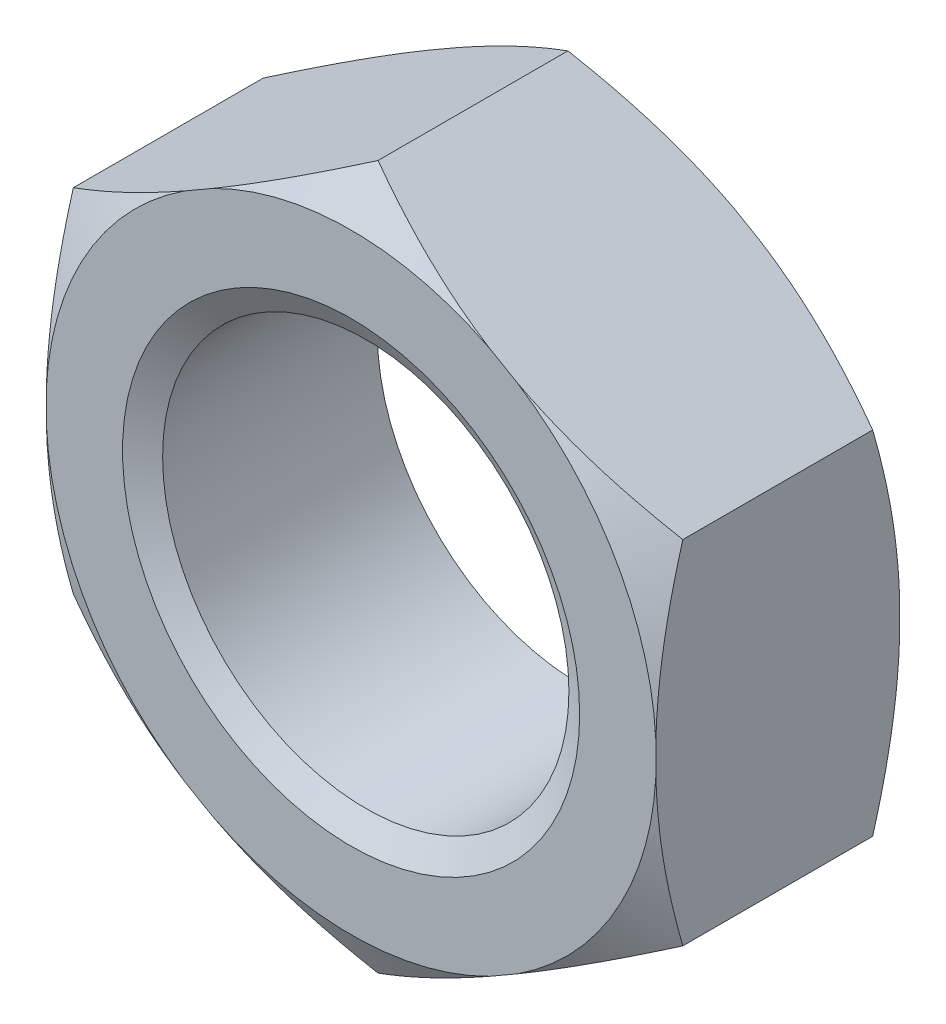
ISO-10303-21;
HEADER;
FILE_DESCRIPTION(('STEP AP214'),'2;1');
FILE_NAME('part.step','',(''),(''),'','','');
FILE_SCHEMA(('AUTOMOTIVE_DESIGN { 1 0 10303 214 1 1 1 1 }'));
ENDSEC;
DATA;
#1=APPLICATION_CONTEXT('core data for automotive mechanical design processes');
#2=APPLICATION_PROTOCOL_DEFINITION('international standard','automotive_design',2000,#1);
#3=PRODUCT_CONTEXT('',#1,'mechanical');
#4=PRODUCT('Part','Part','',(#3));
#5=PRODUCT_RELATED_PRODUCT_CATEGORY('part','',(#4));
#6=PRODUCT_DEFINITION_FORMATION('','',#4);
#7=PRODUCT_DEFINITION_CONTEXT('part definition',#1,'design');
#8=PRODUCT_DEFINITION('design','',#6,#7);
#9=PRODUCT_DEFINITION_SHAPE('','',#8);
#10=(LENGTH_UNIT() NAMED_UNIT(*) SI_UNIT(.MILLI.,.METRE.));
#11=(NAMED_UNIT(*) PLANE_ANGLE_UNIT() SI_UNIT($,.RADIAN.));
#12=(NAMED_UNIT(*) SI_UNIT($,.STERADIAN.) SOLID_ANGLE_UNIT());
#13=UNCERTAINTY_MEASURE_WITH_UNIT(LENGTH_MEASURE(1.E-05),#10,'distance_accuracy_value','');
#14=(GEOMETRIC_REPRESENTATION_CONTEXT(3) GLOBAL_UNCERTAINTY_ASSIGNED_CONTEXT((#13)) GLOBAL_UNIT_ASSIGNED_CONTEXT((#10,
#11,#12)) REPRESENTATION_CONTEXT('',''));
#15=CARTESIAN_POINT('',(0.,0.,0.));
#16=DIRECTION('',(0.,0.,1.));
#17=DIRECTION('',(1.,0.,0.));
#18=AXIS2_PLACEMENT_3D('',#15,#16,#17);
#19=CARTESIAN_POINT('',(15.,8.66025403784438,12.));
#20=DIRECTION('',(-0.5,-0.866025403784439,0.));
#21=DIRECTION('',(0.866025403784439,-0.5,0.));
#22=AXIS2_PLACEMENT_3D('',#19,#20,#21);
#23=PLANE('',#22);
#24=DIRECTION('',(0.,0.,-1.));
#25=VECTOR('',#24,1.);
#26=CARTESIAN_POINT('',(15.,8.66025403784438,12.));
#27=LINE('',#26,#25);
#28=CARTESIAN_POINT('',(15.,8.6602540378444,10.6720943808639));
#29=VERTEX_POINT('',#28);
#30=CARTESIAN_POINT('',(15.,8.6602540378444,1.32790561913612));
#31=VERTEX_POINT('',#30);
#32=EDGE_CURVE('E179',#29,#31,#27,.T.);
#33=ORIENTED_EDGE('',*,*,#32,.T.);
#34=CARTESIAN_POINT('',(25.4230019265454,2.64253106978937,6.0849603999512));
#35=CARTESIAN_POINT('',(25.1873411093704,2.77858990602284,5.95775404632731));
#36=CARTESIAN_POINT('',(24.9513948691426,2.91481353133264,5.83125318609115));
#37=CARTESIAN_POINT('',(24.47888154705,3.18761922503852,5.5798005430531));
#38=CARTESIAN_POINT('',(24.2423144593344,3.32420129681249,5.45484877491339));
#39=CARTESIAN_POINT('',(23.5315584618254,3.73455646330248,5.08249894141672));
#40=CARTESIAN_POINT('',(23.0563696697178,4.00890684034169,4.8376360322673));
#41=CARTESIAN_POINT('',(22.1013757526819,4.56027283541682,4.35527383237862));
#42=CARTESIAN_POINT('',(21.621560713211,4.83729417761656,4.1178006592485));
#43=CARTESIAN_POINT('',(20.6583383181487,5.39341088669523,3.65279499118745));
#44=CARTESIAN_POINT('',(20.174931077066,5.67250618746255,3.42526218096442));
#45=CARTESIAN_POINT('',(19.1915803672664,6.24024398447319,2.97667666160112));
#46=CARTESIAN_POINT('',(18.6915293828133,6.52894855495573,2.75593675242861));
#47=CARTESIAN_POINT('',(17.686385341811,7.10926873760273,2.33016390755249));
#48=CARTESIAN_POINT('',(17.1812920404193,7.40088449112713,2.12513173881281));
#49=CARTESIAN_POINT('',(16.1659444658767,7.98709568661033,1.73467374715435));
#50=CARTESIAN_POINT('',(15.6556956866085,8.28168795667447,1.54922905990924));
#51=CARTESIAN_POINT('',(14.6292075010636,8.87433118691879,1.20222311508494));
#52=CARTESIAN_POINT('',(14.1129688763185,9.17238169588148,1.04065877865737));
#53=CARTESIAN_POINT('',(12.8784941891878,9.88510598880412,0.69119114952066));
#54=CARTESIAN_POINT('',(12.1573831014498,10.3014396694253,0.516272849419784));
#55=CARTESIAN_POINT('',(11.0683367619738,10.9302008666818,0.3059557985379));
#56=CARTESIAN_POINT('',(10.7041089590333,11.1404878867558,0.244528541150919));
#57=CARTESIAN_POINT('',(9.97360702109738,11.5622433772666,0.140561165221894));
#58=CARTESIAN_POINT('',(9.60733290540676,11.7737118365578,0.0980208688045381));
#59=CARTESIAN_POINT('',(8.87770749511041,12.1949612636,0.0334304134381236));
#60=CARTESIAN_POINT('',(8.51437171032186,12.4047332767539,0.0111478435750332));
#61=CARTESIAN_POINT('',(7.78719022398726,12.8245717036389,-0.0131073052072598));
#62=CARTESIAN_POINT('',(7.4233445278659,13.0346381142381,-0.0150800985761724));
#63=CARTESIAN_POINT('',(6.69600266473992,13.4545691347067,0.00134685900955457));
#64=CARTESIAN_POINT('',(6.33250649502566,13.6644337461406,0.0197464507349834));
#65=CARTESIAN_POINT('',(5.60663502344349,14.0835158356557,0.0763610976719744));
#66=CARTESIAN_POINT('',(5.24425990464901,14.2927332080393,0.114579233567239));
#67=CARTESIAN_POINT('',(4.38859435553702,14.7867519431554,0.227251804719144));
#68=CARTESIAN_POINT('',(3.89610296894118,15.0710919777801,0.309859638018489));
#69=CARTESIAN_POINT('',(2.91582392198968,15.6370563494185,0.506281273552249));
#70=CARTESIAN_POINT('',(2.42803695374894,15.9186802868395,0.620099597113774));
#71=CARTESIAN_POINT('',(1.45723028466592,16.4791757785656,0.874646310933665));
#72=CARTESIAN_POINT('',(0.97421662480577,16.7580438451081,1.01540510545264));
#73=CARTESIAN_POINT('',(0.0136075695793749,17.3126517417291,1.31939742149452));
#74=CARTESIAN_POINT('',(-0.463988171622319,17.5883917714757,1.48262949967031));
#75=CARTESIAN_POINT('',(-1.41975911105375,18.1402063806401,1.82974807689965));
#76=CARTESIAN_POINT('',(-1.89787297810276,18.4162455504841,2.01385816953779));
#77=CARTESIAN_POINT('',(-2.84903503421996,18.9653992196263,2.39756921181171));
#78=CARTESIAN_POINT('',(-3.32208634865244,19.2385155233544,2.59715989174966));
#79=CARTESIAN_POINT('',(-4.26384887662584,19.7822423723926,3.00907588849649));
#80=CARTESIAN_POINT('',(-4.73256121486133,20.0528535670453,3.22139779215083));
#81=CARTESIAN_POINT('',(-5.66636266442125,20.5919840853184,3.65658266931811));
#82=CARTESIAN_POINT('',(-6.13145128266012,20.8605031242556,3.87944704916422));
#83=CARTESIAN_POINT('',(-6.91838148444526,21.3148374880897,4.26522047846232));
#84=CARTESIAN_POINT('',(-7.24104644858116,21.5011281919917,4.42589945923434));
#85=CARTESIAN_POINT('',(-7.88495375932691,21.8728882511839,4.75098003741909));
#86=CARTESIAN_POINT('',(-8.20619615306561,22.0583576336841,4.91538151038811));
#87=CARTESIAN_POINT('',(-8.8440031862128,22.4265956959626,5.24570416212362));
#88=CARTESIAN_POINT('',(-9.16058129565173,22.6093721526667,5.41159071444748));
#89=CARTESIAN_POINT('',(-9.79260977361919,22.9742739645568,5.74622188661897));
#90=CARTESIAN_POINT('',(-10.1080601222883,23.1563993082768,5.91496655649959));
#91=CARTESIAN_POINT('',(-10.4230019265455,23.3382310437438,6.08496039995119));
#92=B_SPLINE_CURVE_WITH_KNOTS('',3,(#34,#35,#36,#37,#38,#39,#40,#41,#42,#43,#44,#45,#46,#47,#48,
#49,#50,#51,#52,#53,#54,#55,#56,#57,#58,#59,#60,#61,#62,#63,#64,#65,#66,#67,#68,#69,#70,#71,#72,
#73,#74,#75,#76,#77,#78,#79,#80,#81,#82,#83,#84,#85,#86,#87,#88,#89,#90,#91),.UNSPECIFIED.,.F.,
.F.,(4,2,2,2,2,2,2,2,2,2,2,2,2,2,2,2,2,2,2,2,2,2,2,2,2,2,2,2,4),(0.,0.901144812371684,
1.80229814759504,3.60481465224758,5.41310862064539,7.22134519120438,9.07565220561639,
10.9300497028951,12.7826446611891,14.635000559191,17.184758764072,18.4595159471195,
19.7342611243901,20.9941898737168,22.254105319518,23.5140109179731,24.7741124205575,
26.4970163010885,28.2201699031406,29.9452797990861,31.6702789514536,33.4159004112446,
35.1603735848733,36.9043811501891,38.6486220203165,39.8658579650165,41.0830532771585,
42.2873352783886,43.491638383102),.UNSPECIFIED.);
#93=CARTESIAN_POINT('',(8.17951978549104,12.5980601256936,0.));
#94=VERTEX_POINT('',#93);
#95=EDGE_CURVE('E221',#31,#94,#92,.T.);
#96=ORIENTED_EDGE('',*,*,#95,.T.);
#97=DIRECTION('',(-0.866025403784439,0.5,0.));
#98=VECTOR('',#97,1.);
#99=CARTESIAN_POINT('',(15.,8.66025403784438,0.));
#100=LINE('',#99,#98);
#101=CARTESIAN_POINT('',(6.82048021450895,13.3827019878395,0.));
#102=VERTEX_POINT('',#101);
#103=EDGE_CURVE('E169',#94,#102,#100,.T.);
#104=ORIENTED_EDGE('',*,*,#103,.T.);
#105=CARTESIAN_POINT('',(0.,17.3205080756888,1.32790561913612));
#106=VERTEX_POINT('',#105);
#107=EDGE_CURVE('E355',#102,#106,#92,.T.);
#108=ORIENTED_EDGE('',*,*,#107,.T.);
#109=DIRECTION('',(0.,0.,-1.));
#110=VECTOR('',#109,1.);
#111=CARTESIAN_POINT('',(0.,17.3205080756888,12.));
#112=LINE('',#111,#110);
#113=CARTESIAN_POINT('',(0.,17.3205080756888,10.6720943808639));
#114=VERTEX_POINT('',#113);
#115=EDGE_CURVE('E193',#114,#106,#112,.T.);
#116=ORIENTED_EDGE('',*,*,#115,.F.);
#117=CARTESIAN_POINT('',(-10.4230019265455,23.3382310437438,5.91503960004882));
#118=CARTESIAN_POINT('',(-10.1873411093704,23.2021722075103,6.0422459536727));
#119=CARTESIAN_POINT('',(-9.95139486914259,23.0659485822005,6.16874681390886));
#120=CARTESIAN_POINT('',(-9.47888154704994,22.7931428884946,6.4201994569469));
#121=CARTESIAN_POINT('',(-9.24231445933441,22.6565608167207,6.54515122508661));
#122=CARTESIAN_POINT('',(-8.53155846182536,22.2462056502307,6.91750105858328));
#123=CARTESIAN_POINT('',(-8.05636966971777,21.9718552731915,7.1623639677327));
#124=CARTESIAN_POINT('',(-7.10137575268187,21.4204892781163,7.64472616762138));
#125=CARTESIAN_POINT('',(-6.62156071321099,21.1434679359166,7.8821993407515));
#126=CARTESIAN_POINT('',(-5.65833831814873,20.5873512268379,8.34720500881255));
#127=CARTESIAN_POINT('',(-5.17493107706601,20.3082559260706,8.57473781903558));
#128=CARTESIAN_POINT('',(-4.19158036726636,19.7405181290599,9.02332333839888));
#129=CARTESIAN_POINT('',(-3.69152938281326,19.4518135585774,9.24406324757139));
#130=CARTESIAN_POINT('',(-2.68638534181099,18.8714933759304,9.66983609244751));
#131=CARTESIAN_POINT('',(-2.18129204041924,18.579877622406,9.87486826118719));
#132=CARTESIAN_POINT('',(-1.16594446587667,17.9936664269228,10.2653262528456));
#133=CARTESIAN_POINT('',(-0.65569568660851,17.6990741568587,10.4507709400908));
#134=CARTESIAN_POINT('',(0.37079249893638,17.1064309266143,10.7977768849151));
#135=CARTESIAN_POINT('',(0.887031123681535,16.8083804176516,10.9593412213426));
#136=CARTESIAN_POINT('',(2.12150581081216,16.095656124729,11.3088088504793));
#137=CARTESIAN_POINT('',(2.8426168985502,15.6793224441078,11.4837271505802));
#138=CARTESIAN_POINT('',(3.93166323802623,15.0505612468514,11.6940442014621));
#139=CARTESIAN_POINT('',(4.2958910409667,14.8402742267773,11.7554714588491));
#140=CARTESIAN_POINT('',(5.02639297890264,14.4185187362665,11.8594388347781));
#141=CARTESIAN_POINT('',(5.39266709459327,14.2070502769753,11.9019791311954));
#142=CARTESIAN_POINT('',(6.12229250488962,13.7858008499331,11.9665695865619));
#143=CARTESIAN_POINT('',(6.48562828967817,13.5760288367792,11.988852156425));
#144=CARTESIAN_POINT('',(7.21280977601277,13.1561904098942,12.0131073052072));
#145=CARTESIAN_POINT('',(7.57665547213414,12.9461239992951,12.0150800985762));
#146=CARTESIAN_POINT('',(8.30399733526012,12.5261929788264,11.9986531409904));
#147=CARTESIAN_POINT('',(8.66749350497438,12.3163283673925,11.980253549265));
#148=CARTESIAN_POINT('',(9.39336497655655,11.8972462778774,11.923638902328));
#149=CARTESIAN_POINT('',(9.75574009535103,11.6880289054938,11.8854207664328));
#150=CARTESIAN_POINT('',(10.611405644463,11.1940101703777,11.7727481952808));
#151=CARTESIAN_POINT('',(11.1038970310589,10.909670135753,11.6901403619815));
#152=CARTESIAN_POINT('',(12.0841760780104,10.3437057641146,11.4937187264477));
#153=CARTESIAN_POINT('',(12.5719630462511,10.0620818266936,11.3799004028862));
#154=CARTESIAN_POINT('',(13.5427697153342,9.50158633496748,11.1253536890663));
#155=CARTESIAN_POINT('',(14.0257833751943,9.22271826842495,10.9845948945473));
#156=CARTESIAN_POINT('',(14.9863924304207,8.668110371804,10.6806025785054));
#157=CARTESIAN_POINT('',(15.4639881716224,8.39237034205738,10.5173705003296));
#158=CARTESIAN_POINT('',(16.4197591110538,7.84055573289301,10.1702519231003));
#159=CARTESIAN_POINT('',(16.8978729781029,7.56451656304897,9.98614183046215));
#160=CARTESIAN_POINT('',(17.8490350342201,7.01536289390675,9.60243078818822));
#161=CARTESIAN_POINT('',(18.3220863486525,6.74224659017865,9.40284010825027));
#162=CARTESIAN_POINT('',(19.263848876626,6.1985197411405,8.99092411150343));
#163=CARTESIAN_POINT('',(19.7325612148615,5.92790854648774,8.77860220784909));
#164=CARTESIAN_POINT('',(20.6663626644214,5.38877802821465,8.34341733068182));
#165=CARTESIAN_POINT('',(21.1314512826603,5.1202589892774,8.12055295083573));
#166=CARTESIAN_POINT('',(21.9183814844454,4.66592462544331,7.73477952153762));
#167=CARTESIAN_POINT('',(22.2410464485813,4.4796339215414,7.5741005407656));
#168=CARTESIAN_POINT('',(22.884953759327,4.10787386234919,7.24901996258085));
#169=CARTESIAN_POINT('',(23.2061961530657,3.92240447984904,7.08461848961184));
#170=CARTESIAN_POINT('',(23.8440031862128,3.55416641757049,6.75429583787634));
#171=CARTESIAN_POINT('',(24.1605812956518,3.37138996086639,6.58840928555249));
#172=CARTESIAN_POINT('',(24.7926097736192,3.00648814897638,6.25377811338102));
#173=CARTESIAN_POINT('',(25.1080601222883,2.82436280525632,6.08503344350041));
#174=CARTESIAN_POINT('',(25.4230019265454,2.64253106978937,5.91503960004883));
#175=B_SPLINE_CURVE_WITH_KNOTS('',3,(#117,#118,#119,#120,#121,#122,#123,#124,#125,#126,#127,
#128,#129,#130,#131,#132,#133,#134,#135,#136,#137,#138,#139,#140,#141,#142,#143,#144,#145,#146,
#147,#148,#149,#150,#151,#152,#153,#154,#155,#156,#157,#158,#159,#160,#161,#162,#163,#164,#165,
#166,#167,#168,#169,#170,#171,#172,#173,#174),.UNSPECIFIED.,.F.,.F.,(4,2,2,2,2,2,2,2,2,2,2,2,2,
2,2,2,2,2,2,2,2,2,2,2,2,2,2,2,4),(0.,0.901144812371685,1.80229814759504,3.60481465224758,
5.41310862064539,7.22134519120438,9.0756522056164,10.9300497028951,12.7826446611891,
14.635000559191,17.184758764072,18.4595159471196,19.7342611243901,20.9941898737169,
22.254105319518,23.5140109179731,24.7741124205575,26.4970163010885,28.2201699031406,
29.9452797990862,31.6702789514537,33.4159004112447,35.1603735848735,36.9043811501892,
38.6486220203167,39.8658579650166,41.0830532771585,42.2873352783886,43.491638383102),.UNSPECIFIED.);
#176=CARTESIAN_POINT('',(6.82048021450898,13.3827019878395,12.));
#177=VERTEX_POINT('',#176);
#178=EDGE_CURVE('E321',#114,#177,#175,.T.);
#179=ORIENTED_EDGE('',*,*,#178,.T.);
#180=DIRECTION('',(-0.866025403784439,0.5,0.));
#181=VECTOR('',#180,1.);
#182=CARTESIAN_POINT('',(15.,8.66025403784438,12.));
#183=LINE('',#182,#181);
#184=CARTESIAN_POINT('',(8.17951978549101,12.5980601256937,12.));
#185=VERTEX_POINT('',#184);
#186=EDGE_CURVE('E178',#185,#177,#183,.T.);
#187=ORIENTED_EDGE('',*,*,#186,.F.);
#188=EDGE_CURVE('E327',#185,#29,#175,.T.);
#189=ORIENTED_EDGE('',*,*,#188,.T.);
#190=EDGE_LOOP('',(#33,#96,#104,#108,#116,#179,#187,#189));
#191=FACE_BOUND('',#190,.T.);
#192=ADVANCED_FACE('F14',(#191),#23,.F.);
#193=CARTESIAN_POINT('',(0.,17.3205080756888,12.));
#194=DIRECTION('',(0.5,-0.866025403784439,0.));
#195=DIRECTION('',(0.866025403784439,0.5,0.));
#196=AXIS2_PLACEMENT_3D('',#193,#194,#195);
#197=PLANE('',#196);
#198=ORIENTED_EDGE('',*,*,#115,.T.);
#199=CARTESIAN_POINT('',(10.4230019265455,23.3382310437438,6.08496039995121));
#200=CARTESIAN_POINT('',(10.1873411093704,23.2021722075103,5.95775404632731));
#201=CARTESIAN_POINT('',(9.95139486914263,23.0659485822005,5.83125318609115));
#202=CARTESIAN_POINT('',(9.47888154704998,22.7931428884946,5.5798005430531));
#203=CARTESIAN_POINT('',(9.24231445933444,22.6565608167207,5.4548487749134));
#204=CARTESIAN_POINT('',(8.5315584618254,22.2462056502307,5.08249894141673));
#205=CARTESIAN_POINT('',(8.05636966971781,21.9718552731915,4.83763603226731));
#206=CARTESIAN_POINT('',(7.1013757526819,21.4204892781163,4.35527383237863));
#207=CARTESIAN_POINT('',(6.62156071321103,21.1434679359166,4.11780065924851));
#208=CARTESIAN_POINT('',(5.65833831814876,20.5873512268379,3.65279499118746));
#209=CARTESIAN_POINT('',(5.17493107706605,20.3082559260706,3.42526218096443));
#210=CARTESIAN_POINT('',(4.1915803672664,19.74051812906,2.97667666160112));
#211=CARTESIAN_POINT('',(3.6915293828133,19.4518135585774,2.75593675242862));
#212=CARTESIAN_POINT('',(2.68638534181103,18.8714933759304,2.33016390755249));
#213=CARTESIAN_POINT('',(2.18129204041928,18.579877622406,2.12513173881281));
#214=CARTESIAN_POINT('',(1.16594446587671,17.9936664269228,1.73467374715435));
#215=CARTESIAN_POINT('',(0.655695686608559,17.6990741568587,1.54922905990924));
#216=CARTESIAN_POINT('',(-0.370792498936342,17.1064309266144,1.20222311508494));
#217=CARTESIAN_POINT('',(-0.887031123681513,16.8083804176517,1.04065877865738));
#218=CARTESIAN_POINT('',(-2.12150581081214,16.095656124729,0.691191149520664));
#219=CARTESIAN_POINT('',(-2.84261689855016,15.6793224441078,0.516272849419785));
#220=CARTESIAN_POINT('',(-3.93166323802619,15.0505612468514,0.305955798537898));
#221=CARTESIAN_POINT('',(-4.29589104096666,14.8402742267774,0.244528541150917));
#222=CARTESIAN_POINT('',(-5.02639297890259,14.4185187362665,0.140561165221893));
#223=CARTESIAN_POINT('',(-5.39266709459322,14.2070502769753,0.0980208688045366));
#224=CARTESIAN_POINT('',(-6.12229250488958,13.7858008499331,0.033430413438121));
#225=CARTESIAN_POINT('',(-6.48562828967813,13.5760288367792,0.0111478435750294));
#226=CARTESIAN_POINT('',(-7.21280977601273,13.1561904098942,-0.0131073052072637));
#227=CARTESIAN_POINT('',(-7.57665547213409,12.9461239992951,-0.0150800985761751));
#228=CARTESIAN_POINT('',(-8.30399733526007,12.5261929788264,0.001346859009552));
#229=CARTESIAN_POINT('',(-8.66749350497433,12.3163283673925,0.0197464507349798));
#230=CARTESIAN_POINT('',(-9.3933649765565,11.8972462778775,0.0763610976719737));
#231=CARTESIAN_POINT('',(-9.75574009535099,11.6880289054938,0.114579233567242));
#232=CARTESIAN_POINT('',(-10.611405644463,11.1940101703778,0.22725180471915));
#233=CARTESIAN_POINT('',(-11.1038970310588,10.9096701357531,0.309859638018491));
#234=CARTESIAN_POINT('',(-12.0841760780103,10.3437057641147,0.506281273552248));
#235=CARTESIAN_POINT('',(-12.5719630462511,10.0620818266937,0.620099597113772));
#236=CARTESIAN_POINT('',(-13.5427697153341,9.50158633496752,0.874646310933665));
#237=CARTESIAN_POINT('',(-14.0257833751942,9.22271826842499,1.01540510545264));
#238=CARTESIAN_POINT('',(-14.9863924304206,8.66811037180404,1.31939742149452));
#239=CARTESIAN_POINT('',(-15.4639881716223,8.39237034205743,1.48262949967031));
#240=CARTESIAN_POINT('',(-16.4197591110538,7.84055573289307,1.82974807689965));
#241=CARTESIAN_POINT('',(-16.8978729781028,7.56451656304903,2.01385816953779));
#242=CARTESIAN_POINT('',(-17.8490350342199,7.01536289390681,2.39756921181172));
#243=CARTESIAN_POINT('',(-18.3220863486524,6.74224659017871,2.59715989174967));
#244=CARTESIAN_POINT('',(-19.2638488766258,6.19851974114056,3.00907588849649));
#245=CARTESIAN_POINT('',(-19.7325612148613,5.9279085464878,3.22139779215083));
#246=CARTESIAN_POINT('',(-20.6663626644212,5.38877802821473,3.65658266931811));
#247=CARTESIAN_POINT('',(-21.1314512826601,5.12025898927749,3.87944704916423));
#248=CARTESIAN_POINT('',(-21.9183814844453,4.66592462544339,4.26522047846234));
#249=CARTESIAN_POINT('',(-22.2410464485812,4.47963392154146,4.42589945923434));
#250=CARTESIAN_POINT('',(-22.8849537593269,4.10787386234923,4.7509800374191));
#251=CARTESIAN_POINT('',(-23.2061961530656,3.92240447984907,4.91538151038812));
#252=CARTESIAN_POINT('',(-23.8440031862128,3.5541664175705,5.24570416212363));
#253=CARTESIAN_POINT('',(-24.1605812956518,3.37138996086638,5.4115907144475));
#254=CARTESIAN_POINT('',(-24.7926097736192,3.00648814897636,5.74622188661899));
#255=CARTESIAN_POINT('',(-25.1080601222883,2.82436280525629,5.91496655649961));
#256=CARTESIAN_POINT('',(-25.4230019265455,2.64253106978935,6.08496039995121));
#257=B_SPLINE_CURVE_WITH_KNOTS('',3,(#199,#200,#201,#202,#203,#204,#205,#206,#207,#208,#209,
#210,#211,#212,#213,#214,#215,#216,#217,#218,#219,#220,#221,#222,#223,#224,#225,#226,#227,#228,
#229,#230,#231,#232,#233,#234,#235,#236,#237,#238,#239,#240,#241,#242,#243,#244,#245,#246,#247,
#248,#249,#250,#251,#252,#253,#254,#255,#256),.UNSPECIFIED.,.F.,.F.,(4,2,2,2,2,2,2,2,2,2,2,2,2,
2,2,2,2,2,2,2,2,2,2,2,2,2,2,2,4),(0.,0.901144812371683,1.80229814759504,3.60481465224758,
5.41310862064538,7.22134519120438,9.07565220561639,10.9300497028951,12.7826446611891,
14.635000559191,17.184758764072,18.4595159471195,19.7342611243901,20.9941898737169,
22.254105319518,23.5140109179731,24.7741124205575,26.4970163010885,28.2201699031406,
29.9452797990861,31.6702789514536,33.4159004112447,35.1603735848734,36.9043811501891,
38.6486220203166,39.8658579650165,41.0830532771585,42.2873352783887,43.4916383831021),.UNSPECIFIED.);
#258=CARTESIAN_POINT('',(-6.8204802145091,13.3827019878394,0.));
#259=VERTEX_POINT('',#258);
#260=EDGE_CURVE('E358',#106,#259,#257,.T.);
#261=ORIENTED_EDGE('',*,*,#260,.T.);
#262=DIRECTION('',(-0.866025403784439,-0.5,0.));
#263=VECTOR('',#262,1.);
#264=CARTESIAN_POINT('',(0.,17.3205080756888,0.));
#265=LINE('',#264,#263);
#266=CARTESIAN_POINT('',(-8.17951978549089,12.5980601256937,0.));
#267=VERTEX_POINT('',#266);
#268=EDGE_CURVE('E164',#259,#267,#265,.T.);
#269=ORIENTED_EDGE('',*,*,#268,.T.);
#270=CARTESIAN_POINT('',(-15.,8.66025403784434,1.32790561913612));
#271=VERTEX_POINT('',#270);
#272=EDGE_CURVE('E32',#267,#271,#257,.T.);
#273=ORIENTED_EDGE('',*,*,#272,.T.);
#274=DIRECTION('',(0.,0.,-1.));
#275=VECTOR('',#274,1.);
#276=CARTESIAN_POINT('',(-15.,8.66025403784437,12.));
#277=LINE('',#276,#275);
#278=CARTESIAN_POINT('',(-15.,8.66025403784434,10.6720943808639));
#279=VERTEX_POINT('',#278);
#280=EDGE_CURVE('E157',#279,#271,#277,.T.);
#281=ORIENTED_EDGE('',*,*,#280,.F.);
#282=CARTESIAN_POINT('',(-25.4230019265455,2.64253106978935,5.9150396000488));
#283=CARTESIAN_POINT('',(-25.1873411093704,2.77858990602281,6.04224595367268));
#284=CARTESIAN_POINT('',(-24.9513948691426,2.91481353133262,6.16874681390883));
#285=CARTESIAN_POINT('',(-24.47888154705,3.18761922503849,6.42019945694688));
#286=CARTESIAN_POINT('',(-24.2423144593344,3.32420129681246,6.54515122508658));
#287=CARTESIAN_POINT('',(-23.5315584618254,3.73455646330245,6.91750105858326));
#288=CARTESIAN_POINT('',(-23.0563696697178,4.00890684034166,7.16236396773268));
#289=CARTESIAN_POINT('',(-22.1013757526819,4.5602728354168,7.64472616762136));
#290=CARTESIAN_POINT('',(-21.621560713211,4.83729417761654,7.88219934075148));
#291=CARTESIAN_POINT('',(-20.6583383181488,5.39341088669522,8.34720500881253));
#292=CARTESIAN_POINT('',(-20.174931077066,5.67250618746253,8.57473781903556));
#293=CARTESIAN_POINT('',(-19.1915803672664,6.24024398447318,9.02332333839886));
#294=CARTESIAN_POINT('',(-18.6915293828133,6.52894855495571,9.24406324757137));
#295=CARTESIAN_POINT('',(-17.686385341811,7.10926873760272,9.6698360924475));
#296=CARTESIAN_POINT('',(-17.1812920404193,7.40088449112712,9.87486826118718));
#297=CARTESIAN_POINT('',(-16.1659444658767,7.98709568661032,10.2653262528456));
#298=CARTESIAN_POINT('',(-15.6556956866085,8.28168795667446,10.4507709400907));
#299=CARTESIAN_POINT('',(-14.6292075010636,8.87433118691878,10.797776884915));
#300=CARTESIAN_POINT('',(-14.1129688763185,9.17238169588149,10.9593412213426));
#301=CARTESIAN_POINT('',(-12.8784941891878,9.88510598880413,11.3088088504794));
#302=CARTESIAN_POINT('',(-12.1573831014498,10.3014396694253,11.4837271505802));
#303=CARTESIAN_POINT('',(-11.0683367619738,10.9302008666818,11.6940442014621));
#304=CARTESIAN_POINT('',(-10.7041089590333,11.1404878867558,11.7554714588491));
#305=CARTESIAN_POINT('',(-9.97360702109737,11.5622433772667,11.8594388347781));
#306=CARTESIAN_POINT('',(-9.60733290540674,11.7737118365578,11.9019791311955));
#307=CARTESIAN_POINT('',(-8.87770749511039,12.1949612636,11.9665695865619));
#308=CARTESIAN_POINT('',(-8.51437171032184,12.4047332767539,11.988852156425));
#309=CARTESIAN_POINT('',(-7.78719022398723,12.8245717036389,12.0131073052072));
#310=CARTESIAN_POINT('',(-7.42334452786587,13.0346381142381,12.0150800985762));
#311=CARTESIAN_POINT('',(-6.69600266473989,13.4545691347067,11.9986531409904));
#312=CARTESIAN_POINT('',(-6.33250649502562,13.6644337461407,11.980253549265));
#313=CARTESIAN_POINT('',(-5.60663502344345,14.0835158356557,11.923638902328));
#314=CARTESIAN_POINT('',(-5.24425990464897,14.2927332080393,11.8854207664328));
#315=CARTESIAN_POINT('',(-4.38859435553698,14.7867519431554,11.7727481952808));
#316=CARTESIAN_POINT('',(-3.89610296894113,15.0710919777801,11.6901403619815));
#317=CARTESIAN_POINT('',(-2.91582392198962,15.6370563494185,11.4937187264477));
#318=CARTESIAN_POINT('',(-2.42803695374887,15.9186802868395,11.3799004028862));
#319=CARTESIAN_POINT('',(-1.45723028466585,16.4791757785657,11.1253536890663));
#320=CARTESIAN_POINT('',(-0.974216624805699,16.7580438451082,10.9845948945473));
#321=CARTESIAN_POINT('',(-0.0136075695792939,17.3126517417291,10.6806025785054));
#322=CARTESIAN_POINT('',(0.463988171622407,17.5883917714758,10.5173705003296));
#323=CARTESIAN_POINT('',(1.41975911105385,18.1402063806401,10.1702519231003));
#324=CARTESIAN_POINT('',(1.89787297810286,18.4162455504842,9.98614183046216));
#325=CARTESIAN_POINT('',(2.84903503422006,18.9653992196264,9.60243078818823));
#326=CARTESIAN_POINT('',(3.32208634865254,19.2385155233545,9.40284010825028));
#327=CARTESIAN_POINT('',(4.26384887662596,19.7822423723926,8.99092411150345));
#328=CARTESIAN_POINT('',(4.73256121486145,20.0528535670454,8.77860220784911));
#329=CARTESIAN_POINT('',(5.66636266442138,20.5919840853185,8.34341733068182));
#330=CARTESIAN_POINT('',(6.13145128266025,20.8605031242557,8.12055295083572));
#331=CARTESIAN_POINT('',(6.91838148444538,21.3148374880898,7.73477952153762));
#332=CARTESIAN_POINT('',(7.24104644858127,21.5011281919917,7.5741005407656));
#333=CARTESIAN_POINT('',(7.884953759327,21.8728882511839,7.24901996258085));
#334=CARTESIAN_POINT('',(8.20619615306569,22.0583576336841,7.08461848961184));
#335=CARTESIAN_POINT('',(8.84400318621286,22.4265956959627,6.75429583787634));
#336=CARTESIAN_POINT('',(9.16058129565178,22.6093721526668,6.58840928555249));
#337=CARTESIAN_POINT('',(9.79260977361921,22.9742739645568,6.25377811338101));
#338=CARTESIAN_POINT('',(10.1080601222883,23.1563993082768,6.0850334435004));
#339=CARTESIAN_POINT('',(10.4230019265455,23.3382310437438,5.91503960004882));
#340=B_SPLINE_CURVE_WITH_KNOTS('',3,(#282,#283,#284,#285,#286,#287,#288,#289,#290,#291,#292,
#293,#294,#295,#296,#297,#298,#299,#300,#301,#302,#303,#304,#305,#306,#307,#308,#309,#310,#311,
#312,#313,#314,#315,#316,#317,#318,#319,#320,#321,#322,#323,#324,#325,#326,#327,#328,#329,#330,
#331,#332,#333,#334,#335,#336,#337,#338,#339),.UNSPECIFIED.,.F.,.F.,(4,2,2,2,2,2,2,2,2,2,2,2,2,
2,2,2,2,2,2,2,2,2,2,2,2,2,2,2,4),(0.,0.901144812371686,1.80229814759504,3.60481465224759,
5.4131086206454,7.2213451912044,9.07565220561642,10.9300497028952,12.7826446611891,
14.635000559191,17.184758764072,18.4595159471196,19.7342611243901,20.9941898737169,
22.2541053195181,23.5140109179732,24.7741124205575,26.4970163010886,28.2201699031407,
29.9452797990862,31.6702789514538,33.4159004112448,35.1603735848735,36.9043811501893,
38.6486220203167,39.8658579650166,41.0830532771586,42.2873352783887,43.4916383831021),.UNSPECIFIED.);
#341=CARTESIAN_POINT('',(-8.17951978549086,12.5980601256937,12.));
#342=VERTEX_POINT('',#341);
#343=EDGE_CURVE('E297',#279,#342,#340,.T.);
#344=ORIENTED_EDGE('',*,*,#343,.T.);
#345=DIRECTION('',(-0.866025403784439,-0.5,0.));
#346=VECTOR('',#345,1.);
#347=CARTESIAN_POINT('',(0.,17.3205080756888,12.));
#348=LINE('',#347,#346);
#349=CARTESIAN_POINT('',(-6.82048021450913,13.3827019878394,12.));
#350=VERTEX_POINT('',#349);
#351=EDGE_CURVE('E307',#350,#342,#348,.T.);
#352=ORIENTED_EDGE('',*,*,#351,.F.);
#353=EDGE_CURVE('E304',#350,#114,#340,.T.);
#354=ORIENTED_EDGE('',*,*,#353,.T.);
#355=EDGE_LOOP('',(#198,#261,#269,#273,#281,#344,#352,#354));
#356=FACE_BOUND('',#355,.T.);
#357=ADVANCED_FACE('F276',(#356),#197,.F.);
#358=CARTESIAN_POINT('',(-15.,8.66025403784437,12.));
#359=DIRECTION('',(1.,0.,0.));
#360=DIRECTION('',(0.,1.,0.));
#361=AXIS2_PLACEMENT_3D('',#358,#359,#360);
#362=PLANE('',#361);
#363=ORIENTED_EDGE('',*,*,#280,.T.);
#364=CARTESIAN_POINT('',(-15.,19.0832559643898,5.34183509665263));
#365=CARTESIAN_POINT('',(-15.,18.8122869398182,5.21884162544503));
#366=CARTESIAN_POINT('',(-15.,18.5409436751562,5.09667329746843));
#367=CARTESIAN_POINT('',(-15.,17.9974421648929,4.85415360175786));
#368=CARTESIAN_POINT('',(-15.,17.7252839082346,4.73380225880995));
#369=CARTESIAN_POINT('',(-15.,16.9074065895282,4.37568870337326));
#370=CARTESIAN_POINT('',(-15.,16.3603757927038,4.14090831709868));
#371=CARTESIAN_POINT('',(-15.,15.2599850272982,3.6800058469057));
#372=CARTESIAN_POINT('',(-15.,14.7066081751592,3.45392396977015));
#373=CARTESIAN_POINT('',(-15.,13.5951789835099,3.01358716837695));
#374=CARTESIAN_POINT('',(-15.,13.0371268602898,2.79933170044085));
#375=CARTESIAN_POINT('',(-15.,11.9181507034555,2.386207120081));
#376=CARTESIAN_POINT('',(-15.,11.357250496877,2.18727378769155));
#377=CARTESIAN_POINT('',(-15.,10.2294562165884,1.80696840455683));
#378=CARTESIAN_POINT('',(-15.,9.66256184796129,1.62559722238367));
#379=CARTESIAN_POINT('',(-15.,8.52304587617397,1.2845660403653));
#380=CARTESIAN_POINT('',(-15.,7.95043280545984,1.12487774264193));
#381=CARTESIAN_POINT('',(-15.,6.79857956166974,0.831480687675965));
#382=CARTESIAN_POINT('',(-15.,6.21934032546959,0.697768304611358));
#383=CARTESIAN_POINT('',(-15.,5.21947075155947,0.494696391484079));
#384=CARTESIAN_POINT('',(-15.,4.80036332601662,0.417835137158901));
#385=CARTESIAN_POINT('',(-15.,3.95928202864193,0.281732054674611));
#386=CARTESIAN_POINT('',(-15.,3.5373082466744,0.222489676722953));
#387=CARTESIAN_POINT('',(-15.,2.69119949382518,0.123189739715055));
#388=CARTESIAN_POINT('',(-15.,2.26706509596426,0.083127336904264));
#389=CARTESIAN_POINT('',(-15.,1.41735297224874,0.0233279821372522));
#390=CARTESIAN_POINT('',(-15.,0.991775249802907,0.00359098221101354));
#391=CARTESIAN_POINT('',(-15.,0.14038043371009,-0.0149421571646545));
#392=CARTESIAN_POINT('',(-15.,-0.285436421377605,-0.0137491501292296));
#393=CARTESIAN_POINT('',(-15.,-1.1364913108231,0.00951308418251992));
#394=CARTESIAN_POINT('',(-15.,-1.56172934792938,0.0315822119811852));
#395=CARTESIAN_POINT('',(-15.,-2.4107058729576,0.0959227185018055));
#396=CARTESIAN_POINT('',(-15.,-2.83444420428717,0.138196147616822));
#397=CARTESIAN_POINT('',(-15.,-3.67958328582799,0.241728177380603));
#398=CARTESIAN_POINT('',(-15.,-4.10098393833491,0.302987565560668));
#399=CARTESIAN_POINT('',(-15.,-5.15132842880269,0.47798846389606));
#400=CARTESIAN_POINT('',(-15.,-5.77846191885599,0.60264662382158));
#401=CARTESIAN_POINT('',(-15.,-7.0252024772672,0.885174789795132));
#402=CARTESIAN_POINT('',(-15.,-7.64480783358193,1.04305220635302));
#403=CARTESIAN_POINT('',(-15.,-8.87772381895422,1.38642881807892));
#404=CARTESIAN_POINT('',(-15.,-9.49101743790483,1.57198850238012));
#405=CARTESIAN_POINT('',(-15.,-10.7103687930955,1.96520204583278));
#406=CARTESIAN_POINT('',(-15.,-11.3164270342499,2.17285435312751));
#407=CARTESIAN_POINT('',(-15.,-12.529060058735,2.6084114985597));
#408=CARTESIAN_POINT('',(-15.,-13.1355605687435,2.83652185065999));
#409=CARTESIAN_POINT('',(-15.,-14.3428850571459,3.30733580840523));
#410=CARTESIAN_POINT('',(-15.,-14.9437086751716,3.55004033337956));
#411=CARTESIAN_POINT('',(-15.,-16.1367276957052,4.04565541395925));
#412=CARTESIAN_POINT('',(-15.,-16.7289535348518,4.29849293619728));
#413=CARTESIAN_POINT('',(-15.,-17.6141171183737,4.68480051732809));
#414=CARTESIAN_POINT('',(-15.,-17.9086085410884,4.81472947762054));
#415=CARTESIAN_POINT('',(-15.,-18.4966311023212,5.07672919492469));
#416=CARTESIAN_POINT('',(-15.,-18.790162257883,5.20879991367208));
#417=CARTESIAN_POINT('',(-15.,-19.0832559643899,5.34183509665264));
#418=B_SPLINE_CURVE_WITH_KNOTS('',3,(#364,#365,#366,#367,#368,#369,#370,#371,#372,#373,#374,
#375,#376,#377,#378,#379,#380,#381,#382,#383,#384,#385,#386,#387,#388,#389,#390,#391,#392,#393,
#394,#395,#396,#397,#398,#399,#400,#401,#402,#403,#404,#405,#406,#407,#408,#409,#410,#411,#412,
#413,#414,#415,#416,#417),.UNSPECIFIED.,.F.,.F.,(4,2,2,2,2,2,2,2,2,2,2,2,2,2,2,2,2,2,2,2,2,2,2,
2,2,2,4),(0.,0.892726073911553,1.78546431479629,3.57124012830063,5.36446583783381,
7.15760904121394,8.94277362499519,10.7280264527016,12.5109265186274,14.2935775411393,
15.5715431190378,16.8494688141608,18.1270716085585,19.4046713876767,20.681608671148,
21.9585398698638,23.2356006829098,24.5127144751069,26.4297663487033,28.3472463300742,
30.2689793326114,32.1905774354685,34.1342828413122,36.0781108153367,38.0098243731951,
38.97545759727,39.941073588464),.UNSPECIFIED.);
#419=CARTESIAN_POINT('',(-15.,0.784641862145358,0.));
#420=VERTEX_POINT('',#419);
#421=EDGE_CURVE('E142',#271,#420,#418,.T.);
#422=ORIENTED_EDGE('',*,*,#421,.T.);
#423=DIRECTION('',(0.,-1.,0.));
#424=VECTOR('',#423,1.);
#425=CARTESIAN_POINT('',(-15.,8.66025403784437,0.));
#426=LINE('',#425,#424);
#427=CARTESIAN_POINT('',(-15.,-0.784641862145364,0.));
#428=VERTEX_POINT('',#427);
#429=EDGE_CURVE('E154',#420,#428,#426,.T.);
#430=ORIENTED_EDGE('',*,*,#429,.T.);
#431=CARTESIAN_POINT('',(-15.,-8.66025403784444,1.32790561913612));
#432=VERTEX_POINT('',#431);
#433=EDGE_CURVE('E40',#428,#432,#418,.T.);
#434=ORIENTED_EDGE('',*,*,#433,.T.);
#435=DIRECTION('',(0.,0.,-1.));
#436=VECTOR('',#435,1.);
#437=CARTESIAN_POINT('',(-15.,-8.66025403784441,12.));
#438=LINE('',#437,#436);
#439=CARTESIAN_POINT('',(-15.,-8.66025403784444,10.6720943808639));
#440=VERTEX_POINT('',#439);
#441=EDGE_CURVE('E189',#440,#432,#438,.T.);
#442=ORIENTED_EDGE('',*,*,#441,.F.);
#443=CARTESIAN_POINT('',(-15.,-19.0832559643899,6.65816490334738));
#444=CARTESIAN_POINT('',(-15.,-18.8122869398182,6.78115837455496));
#445=CARTESIAN_POINT('',(-15.,-18.5409436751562,6.90332670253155));
#446=CARTESIAN_POINT('',(-15.,-17.9974421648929,7.14584639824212));
#447=CARTESIAN_POINT('',(-15.,-17.7252839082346,7.26619774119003));
#448=CARTESIAN_POINT('',(-15.,-16.9074065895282,7.62431129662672));
#449=CARTESIAN_POINT('',(-15.,-16.3603757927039,7.8590916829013));
#450=CARTESIAN_POINT('',(-15.,-15.2599850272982,8.31999415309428));
#451=CARTESIAN_POINT('',(-15.,-14.7066081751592,8.54607603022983));
#452=CARTESIAN_POINT('',(-15.,-13.59517898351,8.98641283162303));
#453=CARTESIAN_POINT('',(-15.,-13.0371268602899,9.20066829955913));
#454=CARTESIAN_POINT('',(-15.,-11.9181507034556,9.61379287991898));
#455=CARTESIAN_POINT('',(-15.,-11.357250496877,9.81272621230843));
#456=CARTESIAN_POINT('',(-15.,-10.2294562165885,10.1930315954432));
#457=CARTESIAN_POINT('',(-15.,-9.66256184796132,10.3744027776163));
#458=CARTESIAN_POINT('',(-15.,-8.52304587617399,10.7154339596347));
#459=CARTESIAN_POINT('',(-15.,-7.95043280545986,10.8751222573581));
#460=CARTESIAN_POINT('',(-15.,-6.79857956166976,11.168519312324));
#461=CARTESIAN_POINT('',(-15.,-6.21934032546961,11.3022316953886));
#462=CARTESIAN_POINT('',(-15.,-5.21947075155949,11.5053036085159));
#463=CARTESIAN_POINT('',(-15.,-4.80036332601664,11.5821648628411));
#464=CARTESIAN_POINT('',(-15.,-3.95928202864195,11.7182679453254));
#465=CARTESIAN_POINT('',(-15.,-3.53730824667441,11.777510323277));
#466=CARTESIAN_POINT('',(-15.,-2.6911994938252,11.8768102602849));
#467=CARTESIAN_POINT('',(-15.,-2.26706509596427,11.9168726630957));
#468=CARTESIAN_POINT('',(-15.,-1.41735297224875,11.9766720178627));
#469=CARTESIAN_POINT('',(-15.,-0.991775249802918,11.996409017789));
#470=CARTESIAN_POINT('',(-15.,-0.140380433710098,12.0149421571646));
#471=CARTESIAN_POINT('',(-15.,0.285436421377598,12.0137491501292));
#472=CARTESIAN_POINT('',(-15.,1.13649131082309,11.9904869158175));
#473=CARTESIAN_POINT('',(-15.,1.56172934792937,11.9684177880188));
#474=CARTESIAN_POINT('',(-15.,2.41070587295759,11.9040772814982));
#475=CARTESIAN_POINT('',(-15.,2.83444420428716,11.8618038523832));
#476=CARTESIAN_POINT('',(-15.,3.67958328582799,11.7582718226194));
#477=CARTESIAN_POINT('',(-15.,4.10098393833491,11.6970124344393));
#478=CARTESIAN_POINT('',(-15.,5.15132842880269,11.5220115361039));
#479=CARTESIAN_POINT('',(-15.,5.77846191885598,11.3973533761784));
#480=CARTESIAN_POINT('',(-15.,7.02520247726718,11.1148252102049));
#481=CARTESIAN_POINT('',(-15.,7.6448078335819,10.956947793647));
#482=CARTESIAN_POINT('',(-15.,8.8777238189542,10.6135711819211));
#483=CARTESIAN_POINT('',(-15.,9.4910174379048,10.4280114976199));
#484=CARTESIAN_POINT('',(-15.,10.7103687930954,10.0347979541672));
#485=CARTESIAN_POINT('',(-15.,11.3164270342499,9.82714564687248));
#486=CARTESIAN_POINT('',(-15.,12.529060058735,9.39158850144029));
#487=CARTESIAN_POINT('',(-15.,13.1355605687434,9.16347814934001));
#488=CARTESIAN_POINT('',(-15.,14.3428850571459,8.69266419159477));
#489=CARTESIAN_POINT('',(-15.,14.9437086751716,8.44995966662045));
#490=CARTESIAN_POINT('',(-15.,16.1367276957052,7.95434458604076));
#491=CARTESIAN_POINT('',(-15.,16.7289535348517,7.70150706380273));
#492=CARTESIAN_POINT('',(-15.,17.6141171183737,7.31519948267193));
#493=CARTESIAN_POINT('',(-15.,17.9086085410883,7.18527052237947));
#494=CARTESIAN_POINT('',(-15.,18.4966311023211,6.92327080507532));
#495=CARTESIAN_POINT('',(-15.,18.790162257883,6.79120008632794));
#496=CARTESIAN_POINT('',(-15.,19.0832559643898,6.65816490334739));
#497=B_SPLINE_CURVE_WITH_KNOTS('',3,(#443,#444,#445,#446,#447,#448,#449,#450,#451,#452,#453,
#454,#455,#456,#457,#458,#459,#460,#461,#462,#463,#464,#465,#466,#467,#468,#469,#470,#471,#472,
#473,#474,#475,#476,#477,#478,#479,#480,#481,#482,#483,#484,#485,#486,#487,#488,#489,#490,#491,
#492,#493,#494,#495,#496),.UNSPECIFIED.,.F.,.F.,(4,2,2,2,2,2,2,2,2,2,2,2,2,2,2,2,2,2,2,2,2,2,2,
2,2,2,4),(0.,0.892726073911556,1.78546431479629,3.57124012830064,5.36446583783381,
7.15760904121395,8.9427736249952,10.7280264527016,12.5109265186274,14.2935775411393,
15.5715431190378,16.8494688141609,18.1270716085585,19.4046713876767,20.6816086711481,
21.9585398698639,23.2356006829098,24.5127144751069,26.4297663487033,28.3472463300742,
30.2689793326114,32.1905774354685,34.1342828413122,36.0781108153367,38.0098243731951,
38.9754575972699,39.941073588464),.UNSPECIFIED.);
#498=CARTESIAN_POINT('',(-15.,-0.784641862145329,12.));
#499=VERTEX_POINT('',#498);
#500=EDGE_CURVE('E281',#440,#499,#497,.T.);
#501=ORIENTED_EDGE('',*,*,#500,.T.);
#502=DIRECTION('',(0.,-1.,0.));
#503=VECTOR('',#502,1.);
#504=CARTESIAN_POINT('',(-15.,8.66025403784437,12.));
#505=LINE('',#504,#503);
#506=CARTESIAN_POINT('',(-15.,0.784641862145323,12.));
#507=VERTEX_POINT('',#506);
#508=EDGE_CURVE('E310',#507,#499,#505,.T.);
#509=ORIENTED_EDGE('',*,*,#508,.F.);
#510=EDGE_CURVE('E289',#507,#279,#497,.T.);
#511=ORIENTED_EDGE('',*,*,#510,.T.);
#512=EDGE_LOOP('',(#363,#422,#430,#434,#442,#501,#509,#511));
#513=FACE_BOUND('',#512,.T.);
#514=ADVANCED_FACE('F153',(#513),#362,.F.);
#515=CARTESIAN_POINT('',(-15.,-8.66025403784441,12.));
#516=DIRECTION('',(0.5,0.866025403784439,0.));
#517=DIRECTION('',(-0.866025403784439,0.5,0.));
#518=AXIS2_PLACEMENT_3D('',#515,#516,#517);
#519=PLANE('',#518);
#520=ORIENTED_EDGE('',*,*,#441,.T.);
#521=CARTESIAN_POINT('',(-25.4230019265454,-2.64253106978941,6.08496039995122));
#522=CARTESIAN_POINT('',(-25.1873411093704,-2.77858990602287,5.95775404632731));
#523=CARTESIAN_POINT('',(-24.9513948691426,-2.91481353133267,5.83125318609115));
#524=CARTESIAN_POINT('',(-24.47888154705,-3.18761922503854,5.5798005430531));
#525=CARTESIAN_POINT('',(-24.2423144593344,-3.32420129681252,5.4548487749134));
#526=CARTESIAN_POINT('',(-23.5315584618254,-3.7345564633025,5.08249894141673));
#527=CARTESIAN_POINT('',(-23.0563696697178,-4.00890684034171,4.8376360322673));
#528=CARTESIAN_POINT('',(-22.1013757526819,-4.56027283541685,4.35527383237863));
#529=CARTESIAN_POINT('',(-21.621560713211,-4.83729417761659,4.11780065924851));
#530=CARTESIAN_POINT('',(-20.6583383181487,-5.39341088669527,3.65279499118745));
#531=CARTESIAN_POINT('',(-20.174931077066,-5.67250618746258,3.42526218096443));
#532=CARTESIAN_POINT('',(-19.1915803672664,-6.24024398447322,2.97667666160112));
#533=CARTESIAN_POINT('',(-18.6915293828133,-6.52894855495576,2.75593675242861));
#534=CARTESIAN_POINT('',(-17.686385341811,-7.10926873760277,2.33016390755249));
#535=CARTESIAN_POINT('',(-17.1812920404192,-7.40088449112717,2.12513173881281));
#536=CARTESIAN_POINT('',(-16.1659444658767,-7.98709568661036,1.73467374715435));
#537=CARTESIAN_POINT('',(-15.6556956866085,-8.28168795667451,1.54922905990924));
#538=CARTESIAN_POINT('',(-14.6292075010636,-8.87433118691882,1.20222311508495));
#539=CARTESIAN_POINT('',(-14.1129688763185,-9.17238169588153,1.04065877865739));
#540=CARTESIAN_POINT('',(-12.8784941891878,-9.88510598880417,0.691191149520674));
#541=CARTESIAN_POINT('',(-12.1573831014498,-10.3014396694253,0.516272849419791));
#542=CARTESIAN_POINT('',(-11.0683367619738,-10.9302008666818,0.305955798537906));
#543=CARTESIAN_POINT('',(-10.7041089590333,-11.1404878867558,0.244528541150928));
#544=CARTESIAN_POINT('',(-9.97360702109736,-11.5622433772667,0.140561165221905));
#545=CARTESIAN_POINT('',(-9.60733290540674,-11.7737118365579,0.0980208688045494));
#546=CARTESIAN_POINT('',(-8.87770749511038,-12.1949612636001,0.0334304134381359));
#547=CARTESIAN_POINT('',(-8.51437171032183,-12.4047332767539,0.0111478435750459));
#548=CARTESIAN_POINT('',(-7.78719022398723,-12.8245717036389,-0.0131073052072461));
#549=CARTESIAN_POINT('',(-7.42334452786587,-13.0346381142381,-0.015080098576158));
#550=CARTESIAN_POINT('',(-6.69600266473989,-13.4545691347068,0.00134685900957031));
#551=CARTESIAN_POINT('',(-6.33250649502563,-13.6644337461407,0.0197464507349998));
#552=CARTESIAN_POINT('',(-5.60663502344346,-14.0835158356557,0.0763610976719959));
#553=CARTESIAN_POINT('',(-5.24425990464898,-14.2927332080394,0.114579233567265));
#554=CARTESIAN_POINT('',(-4.38859435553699,-14.7867519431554,0.227251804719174));
#555=CARTESIAN_POINT('',(-3.89610296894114,-15.0710919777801,0.309859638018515));
#556=CARTESIAN_POINT('',(-2.91582392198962,-15.6370563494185,0.506281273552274));
#557=CARTESIAN_POINT('',(-2.42803695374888,-15.9186802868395,0.620099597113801));
#558=CARTESIAN_POINT('',(-1.45723028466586,-16.4791757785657,0.874646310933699));
#559=CARTESIAN_POINT('',(-0.974216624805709,-16.7580438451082,1.01540510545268));
#560=CARTESIAN_POINT('',(-0.0136075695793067,-17.3126517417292,1.31939742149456));
#561=CARTESIAN_POINT('',(0.463988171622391,-17.5883917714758,1.48262949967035));
#562=CARTESIAN_POINT('',(1.41975911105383,-18.1402063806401,1.82974807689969));
#563=CARTESIAN_POINT('',(1.89787297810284,-18.4162455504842,2.01385816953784));
#564=CARTESIAN_POINT('',(2.84903503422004,-18.9653992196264,2.39756921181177));
#565=CARTESIAN_POINT('',(3.32208634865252,-19.2385155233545,2.59715989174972));
#566=CARTESIAN_POINT('',(4.26384887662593,-19.7822423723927,3.00907588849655));
#567=CARTESIAN_POINT('',(4.73256121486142,-20.0528535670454,3.22139779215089));
#568=CARTESIAN_POINT('',(5.66636266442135,-20.5919840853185,3.65658266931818));
#569=CARTESIAN_POINT('',(6.13145128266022,-20.8605031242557,3.87944704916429));
#570=CARTESIAN_POINT('',(6.91838148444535,-21.3148374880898,4.26522047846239));
#571=CARTESIAN_POINT('',(7.24104644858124,-21.5011281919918,4.42589945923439));
#572=CARTESIAN_POINT('',(7.88495375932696,-21.872888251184,4.75098003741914));
#573=CARTESIAN_POINT('',(8.20619615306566,-22.0583576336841,4.91538151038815));
#574=CARTESIAN_POINT('',(8.84400318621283,-22.4265956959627,5.24570416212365));
#575=CARTESIAN_POINT('',(9.16058129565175,-22.6093721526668,5.41159071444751));
#576=CARTESIAN_POINT('',(9.79260977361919,-22.9742739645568,5.74622188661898));
#577=CARTESIAN_POINT('',(10.1080601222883,-23.1563993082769,5.9149665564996));
#578=CARTESIAN_POINT('',(10.4230019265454,-23.3382310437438,6.0849603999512));
#579=B_SPLINE_CURVE_WITH_KNOTS('',3,(#521,#522,#523,#524,#525,#526,#527,#528,#529,#530,#531,
#532,#533,#534,#535,#536,#537,#538,#539,#540,#541,#542,#543,#544,#545,#546,#547,#548,#549,#550,
#551,#552,#553,#554,#555,#556,#557,#558,#559,#560,#561,#562,#563,#564,#565,#566,#567,#568,#569,
#570,#571,#572,#573,#574,#575,#576,#577,#578),.UNSPECIFIED.,.F.,.F.,(4,2,2,2,2,2,2,2,2,2,2,2,2,
2,2,2,2,2,2,2,2,2,2,2,2,2,2,2,4),(0.,0.901144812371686,1.80229814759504,3.60481465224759,
5.41310862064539,7.22134519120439,9.0756522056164,10.9300497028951,12.7826446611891,
14.635000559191,17.184758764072,18.4595159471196,19.7342611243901,20.9941898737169,
22.254105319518,23.5140109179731,24.7741124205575,26.4970163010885,28.2201699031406,
29.9452797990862,31.6702789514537,33.4159004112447,35.1603735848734,36.9043811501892,
38.6486220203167,39.8658579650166,41.0830532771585,42.2873352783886,43.491638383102),.UNSPECIFIED.);
#580=CARTESIAN_POINT('',(-8.17951978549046,-12.598060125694,0.));
#581=VERTEX_POINT('',#580);
#582=EDGE_CURVE('E267',#432,#581,#579,.T.);
#583=ORIENTED_EDGE('',*,*,#582,.T.);
#584=DIRECTION('',(0.866025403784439,-0.5,0.));
#585=VECTOR('',#584,1.);
#586=CARTESIAN_POINT('',(-15.,-8.66025403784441,0.));
#587=LINE('',#586,#585);
#588=CARTESIAN_POINT('',(-6.82048021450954,-13.3827019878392,0.));
#589=VERTEX_POINT('',#588);
#590=EDGE_CURVE('E163',#581,#589,#587,.T.);
#591=ORIENTED_EDGE('',*,*,#590,.T.);
#592=CARTESIAN_POINT('',(0.,-17.3205080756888,1.32790561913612));
#593=VERTEX_POINT('',#592);
#594=EDGE_CURVE('E256',#589,#593,#579,.T.);
#595=ORIENTED_EDGE('',*,*,#594,.T.);
#596=DIRECTION('',(0.,0.,-1.));
#597=VECTOR('',#596,1.);
#598=CARTESIAN_POINT('',(0.,-17.3205080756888,12.));
#599=LINE('',#598,#597);
#600=CARTESIAN_POINT('',(0.,-17.3205080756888,10.6720943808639));
#601=VERTEX_POINT('',#600);
#602=EDGE_CURVE('E186',#601,#593,#599,.T.);
#603=ORIENTED_EDGE('',*,*,#602,.F.);
#604=CARTESIAN_POINT('',(10.4230019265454,-23.3382310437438,5.91503960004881));
#605=CARTESIAN_POINT('',(10.1873411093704,-23.2021722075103,6.04224595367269));
#606=CARTESIAN_POINT('',(9.95139486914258,-23.0659485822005,6.16874681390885));
#607=CARTESIAN_POINT('',(9.47888154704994,-22.7931428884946,6.42019945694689));
#608=CARTESIAN_POINT('',(9.24231445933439,-22.6565608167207,6.5451512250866));
#609=CARTESIAN_POINT('',(8.53155846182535,-22.2462056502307,6.91750105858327));
#610=CARTESIAN_POINT('',(8.05636966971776,-21.9718552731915,7.16236396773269));
#611=CARTESIAN_POINT('',(7.10137575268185,-21.4204892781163,7.64472616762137));
#612=CARTESIAN_POINT('',(6.62156071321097,-21.1434679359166,7.88219934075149));
#613=CARTESIAN_POINT('',(5.65833831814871,-20.5873512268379,8.34720500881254));
#614=CARTESIAN_POINT('',(5.17493107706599,-20.3082559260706,8.57473781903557));
#615=CARTESIAN_POINT('',(4.19158036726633,-19.74051812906,9.02332333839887));
#616=CARTESIAN_POINT('',(3.69152938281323,-19.4518135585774,9.24406324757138));
#617=CARTESIAN_POINT('',(2.68638534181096,-18.8714933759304,9.6698360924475));
#618=CARTESIAN_POINT('',(2.18129204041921,-18.579877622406,9.87486826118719));
#619=CARTESIAN_POINT('',(1.16594446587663,-17.9936664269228,10.2653262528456));
#620=CARTESIAN_POINT('',(0.655695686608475,-17.6990741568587,10.4507709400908));
#621=CARTESIAN_POINT('',(-0.370792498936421,-17.1064309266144,10.797776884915));
#622=CARTESIAN_POINT('',(-0.88703112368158,-16.8083804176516,10.9593412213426));
#623=CARTESIAN_POINT('',(-2.12150581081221,-16.095656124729,11.3088088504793));
#624=CARTESIAN_POINT('',(-2.84261689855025,-15.6793224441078,11.4837271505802));
#625=CARTESIAN_POINT('',(-3.93166323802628,-15.0505612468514,11.6940442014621));
#626=CARTESIAN_POINT('',(-4.29589104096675,-14.8402742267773,11.7554714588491));
#627=CARTESIAN_POINT('',(-5.02639297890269,-14.4185187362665,11.8594388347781));
#628=CARTESIAN_POINT('',(-5.39266709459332,-14.2070502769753,11.9019791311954));
#629=CARTESIAN_POINT('',(-6.12229250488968,-13.7858008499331,11.9665695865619));
#630=CARTESIAN_POINT('',(-6.48562828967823,-13.5760288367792,11.9888521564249));
#631=CARTESIAN_POINT('',(-7.21280977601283,-13.1561904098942,12.0131073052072));
#632=CARTESIAN_POINT('',(-7.57665547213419,-12.9461239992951,12.0150800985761));
#633=CARTESIAN_POINT('',(-8.30399733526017,-12.5261929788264,11.9986531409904));
#634=CARTESIAN_POINT('',(-8.66749350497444,-12.3163283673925,11.980253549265));
#635=CARTESIAN_POINT('',(-9.39336497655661,-11.8972462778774,11.923638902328));
#636=CARTESIAN_POINT('',(-9.75574009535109,-11.6880289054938,11.8854207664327));
#637=CARTESIAN_POINT('',(-10.6114056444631,-11.1940101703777,11.7727481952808));
#638=CARTESIAN_POINT('',(-11.1038970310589,-10.909670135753,11.6901403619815));
#639=CARTESIAN_POINT('',(-12.0841760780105,-10.3437057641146,11.4937187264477));
#640=CARTESIAN_POINT('',(-12.5719630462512,-10.0620818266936,11.3799004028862));
#641=CARTESIAN_POINT('',(-13.5427697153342,-9.50158633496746,11.1253536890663));
#642=CARTESIAN_POINT('',(-14.0257833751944,-9.22271826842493,10.9845948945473));
#643=CARTESIAN_POINT('',(-14.9863924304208,-8.66811037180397,10.6806025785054));
#644=CARTESIAN_POINT('',(-15.4639881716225,-8.39237034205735,10.5173705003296));
#645=CARTESIAN_POINT('',(-16.419759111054,-7.84055573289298,10.1702519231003));
#646=CARTESIAN_POINT('',(-16.897872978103,-7.56451656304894,9.9861418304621));
#647=CARTESIAN_POINT('',(-17.8490350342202,-7.01536289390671,9.60243078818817));
#648=CARTESIAN_POINT('',(-18.3220863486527,-6.74224659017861,9.40284010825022));
#649=CARTESIAN_POINT('',(-19.2638488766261,-6.19851974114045,8.99092411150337));
#650=CARTESIAN_POINT('',(-19.7325612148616,-5.92790854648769,8.77860220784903));
#651=CARTESIAN_POINT('',(-20.6663626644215,-5.3887780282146,8.34341733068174));
#652=CARTESIAN_POINT('',(-21.1314512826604,-5.12025898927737,8.12055295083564));
#653=CARTESIAN_POINT('',(-21.9183814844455,-4.66592462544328,7.73477952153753));
#654=CARTESIAN_POINT('',(-22.2410464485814,-4.47963392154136,7.57410054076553));
#655=CARTESIAN_POINT('',(-22.8849537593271,-4.10787386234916,7.2490199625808));
#656=CARTESIAN_POINT('',(-23.2061961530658,-3.92240447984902,7.08461848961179));
#657=CARTESIAN_POINT('',(-23.8440031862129,-3.55416641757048,6.75429583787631));
#658=CARTESIAN_POINT('',(-24.1605812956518,-3.37138996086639,6.58840928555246));
#659=CARTESIAN_POINT('',(-24.7926097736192,-3.0064881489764,6.253778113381));
#660=CARTESIAN_POINT('',(-25.1080601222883,-2.82436280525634,6.0850334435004));
#661=CARTESIAN_POINT('',(-25.4230019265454,-2.64253106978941,5.91503960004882));
#662=B_SPLINE_CURVE_WITH_KNOTS('',3,(#604,#605,#606,#607,#608,#609,#610,#611,#612,#613,#614,
#615,#616,#617,#618,#619,#620,#621,#622,#623,#624,#625,#626,#627,#628,#629,#630,#631,#632,#633,
#634,#635,#636,#637,#638,#639,#640,#641,#642,#643,#644,#645,#646,#647,#648,#649,#650,#651,#652,
#653,#654,#655,#656,#657,#658,#659,#660,#661),.UNSPECIFIED.,.F.,.F.,(4,2,2,2,2,2,2,2,2,2,2,2,2,
2,2,2,2,2,2,2,2,2,2,2,2,2,2,2,4),(0.,0.901144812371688,1.80229814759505,3.6048146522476,
5.4131086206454,7.2213451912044,9.07565220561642,10.9300497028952,12.7826446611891,
14.6350005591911,17.184758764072,18.4595159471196,19.7342611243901,20.9941898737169,
22.2541053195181,23.5140109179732,24.7741124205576,26.4970163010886,28.2201699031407,
29.9452797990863,31.6702789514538,33.4159004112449,35.1603735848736,36.9043811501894,
38.6486220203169,39.8658579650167,41.0830532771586,42.2873352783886,43.491638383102),.UNSPECIFIED.);
#663=CARTESIAN_POINT('',(-6.82048021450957,-13.3827019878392,12.));
#664=VERTEX_POINT('',#663);
#665=EDGE_CURVE('E291',#601,#664,#662,.T.);
#666=ORIENTED_EDGE('',*,*,#665,.T.);
#667=DIRECTION('',(0.866025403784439,-0.5,0.));
#668=VECTOR('',#667,1.);
#669=CARTESIAN_POINT('',(-15.,-8.66025403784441,12.));
#670=LINE('',#669,#668);
#671=CARTESIAN_POINT('',(-8.17951978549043,-12.598060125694,12.));
#672=VERTEX_POINT('',#671);
#673=EDGE_CURVE('E313',#672,#664,#670,.T.);
#674=ORIENTED_EDGE('',*,*,#673,.F.);
#675=EDGE_CURVE('E290',#672,#440,#662,.T.);
#676=ORIENTED_EDGE('',*,*,#675,.T.);
#677=EDGE_LOOP('',(#520,#583,#591,#595,#603,#666,#674,#676));
#678=FACE_BOUND('',#677,.T.);
#679=ADVANCED_FACE('F275',(#678),#519,.F.);
#680=CARTESIAN_POINT('',(0.,-17.3205080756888,12.));
#681=DIRECTION('',(-0.5,0.866025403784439,0.));
#682=DIRECTION('',(-0.866025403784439,-0.5,0.));
#683=AXIS2_PLACEMENT_3D('',#680,#681,#682);
#684=PLANE('',#683);
#685=ORIENTED_EDGE('',*,*,#602,.T.);
#686=CARTESIAN_POINT('',(-10.4230019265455,-23.3382310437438,6.08496039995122));
#687=CARTESIAN_POINT('',(-10.1873411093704,-23.2021722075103,5.95775404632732));
#688=CARTESIAN_POINT('',(-9.95139486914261,-23.0659485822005,5.83125318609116));
#689=CARTESIAN_POINT('',(-9.47888154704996,-22.7931428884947,5.57980054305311));
#690=CARTESIAN_POINT('',(-9.24231445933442,-22.6565608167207,5.45484877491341));
#691=CARTESIAN_POINT('',(-8.53155846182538,-22.2462056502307,5.08249894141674));
#692=CARTESIAN_POINT('',(-8.05636966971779,-21.9718552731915,4.83763603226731));
#693=CARTESIAN_POINT('',(-7.10137575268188,-21.4204892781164,4.35527383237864));
#694=CARTESIAN_POINT('',(-6.62156071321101,-21.1434679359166,4.11780065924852));
#695=CARTESIAN_POINT('',(-5.65833831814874,-20.5873512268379,3.65279499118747));
#696=CARTESIAN_POINT('',(-5.17493107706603,-20.3082559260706,3.42526218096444));
#697=CARTESIAN_POINT('',(-4.19158036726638,-19.74051812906,2.97667666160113));
#698=CARTESIAN_POINT('',(-3.69152938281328,-19.4518135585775,2.75593675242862));
#699=CARTESIAN_POINT('',(-2.68638534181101,-18.8714933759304,2.3301639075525));
#700=CARTESIAN_POINT('',(-2.18129204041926,-18.579877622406,2.12513173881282));
#701=CARTESIAN_POINT('',(-1.16594446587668,-17.9936664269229,1.73467374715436));
#702=CARTESIAN_POINT('',(-0.655695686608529,-17.6990741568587,1.54922905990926));
#703=CARTESIAN_POINT('',(0.370792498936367,-17.1064309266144,1.20222311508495));
#704=CARTESIAN_POINT('',(0.887031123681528,-16.8083804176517,1.04065877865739));
#705=CARTESIAN_POINT('',(2.12150581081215,-16.095656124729,0.69119114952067));
#706=CARTESIAN_POINT('',(2.84261689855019,-15.6793224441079,0.516272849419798));
#707=CARTESIAN_POINT('',(3.93166323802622,-15.0505612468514,0.305955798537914));
#708=CARTESIAN_POINT('',(4.29589104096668,-14.8402742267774,0.244528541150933));
#709=CARTESIAN_POINT('',(5.02639297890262,-14.4185187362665,0.140561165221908));
#710=CARTESIAN_POINT('',(5.39266709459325,-14.2070502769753,0.0980208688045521));
#711=CARTESIAN_POINT('',(6.12229250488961,-13.7858008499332,0.0334304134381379));
#712=CARTESIAN_POINT('',(6.48562828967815,-13.5760288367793,0.0111478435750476));
#713=CARTESIAN_POINT('',(7.21280977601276,-13.1561904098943,-0.0131073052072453));
#714=CARTESIAN_POINT('',(7.57665547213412,-12.9461239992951,-0.0150800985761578));
#715=CARTESIAN_POINT('',(8.3039973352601,-12.5261929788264,0.00134685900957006));
#716=CARTESIAN_POINT('',(8.66749350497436,-12.3163283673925,0.0197464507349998));
#717=CARTESIAN_POINT('',(9.39336497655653,-11.8972462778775,0.0763610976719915));
#718=CARTESIAN_POINT('',(9.75574009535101,-11.6880289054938,0.114579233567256));
#719=CARTESIAN_POINT('',(10.611405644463,-11.1940101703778,0.227251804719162));
#720=CARTESIAN_POINT('',(11.1038970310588,-10.9096701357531,0.309859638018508));
#721=CARTESIAN_POINT('',(12.0841760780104,-10.3437057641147,0.50628127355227));
#722=CARTESIAN_POINT('',(12.5719630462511,-10.0620818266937,0.620099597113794));
#723=CARTESIAN_POINT('',(13.5427697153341,-9.50158633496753,0.874646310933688));
#724=CARTESIAN_POINT('',(14.0257833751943,-9.22271826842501,1.01540510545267));
#725=CARTESIAN_POINT('',(14.9863924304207,-8.66811037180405,1.31939742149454));
#726=CARTESIAN_POINT('',(15.4639881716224,-8.39237034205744,1.48262949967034));
#727=CARTESIAN_POINT('',(16.4197591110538,-7.84055573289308,1.82974807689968));
#728=CARTESIAN_POINT('',(16.8978729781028,-7.56451656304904,2.01385816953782));
#729=CARTESIAN_POINT('',(17.84903503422,-7.01536289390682,2.39756921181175));
#730=CARTESIAN_POINT('',(18.3220863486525,-6.74224659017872,2.5971598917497));
#731=CARTESIAN_POINT('',(19.2638488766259,-6.19851974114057,3.00907588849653));
#732=CARTESIAN_POINT('',(19.7325612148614,-5.92790854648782,3.22139779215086));
#733=CARTESIAN_POINT('',(20.6663626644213,-5.38877802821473,3.65658266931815));
#734=CARTESIAN_POINT('',(21.1314512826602,-5.12025898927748,3.87944704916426));
#735=CARTESIAN_POINT('',(21.9183814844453,-4.66592462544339,4.26522047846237));
#736=CARTESIAN_POINT('',(22.2410464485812,-4.47963392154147,4.42589945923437));
#737=CARTESIAN_POINT('',(22.8849537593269,-4.10787386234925,4.75098003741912));
#738=CARTESIAN_POINT('',(23.2061961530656,-3.9224044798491,4.91538151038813));
#739=CARTESIAN_POINT('',(23.8440031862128,-3.55416641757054,5.24570416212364));
#740=CARTESIAN_POINT('',(24.1605812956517,-3.37138996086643,5.41159071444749));
#741=CARTESIAN_POINT('',(24.7926097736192,-3.00648814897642,5.74622188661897));
#742=CARTESIAN_POINT('',(25.1080601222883,-2.82436280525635,5.91496655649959));
#743=CARTESIAN_POINT('',(25.4230019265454,-2.6425310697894,6.08496039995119));
#744=B_SPLINE_CURVE_WITH_KNOTS('',3,(#686,#687,#688,#689,#690,#691,#692,#693,#694,#695,#696,
#697,#698,#699,#700,#701,#702,#703,#704,#705,#706,#707,#708,#709,#710,#711,#712,#713,#714,#715,
#716,#717,#718,#719,#720,#721,#722,#723,#724,#725,#726,#727,#728,#729,#730,#731,#732,#733,#734,
#735,#736,#737,#738,#739,#740,#741,#742,#743),.UNSPECIFIED.,.F.,.F.,(4,2,2,2,2,2,2,2,2,2,2,2,2,
2,2,2,2,2,2,2,2,2,2,2,2,2,2,2,4),(0.,0.901144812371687,1.80229814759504,3.60481465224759,
5.41310862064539,7.22134519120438,9.0756522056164,10.9300497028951,12.7826446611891,
14.635000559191,17.184758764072,18.4595159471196,19.7342611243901,20.9941898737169,
22.254105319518,23.5140109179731,24.7741124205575,26.4970163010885,28.2201699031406,
29.9452797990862,31.6702789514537,33.4159004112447,35.1603735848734,36.9043811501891,
38.6486220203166,39.8658579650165,41.0830532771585,42.2873352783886,43.491638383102),.UNSPECIFIED.);
#745=CARTESIAN_POINT('',(6.82048021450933,-13.3827019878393,0.));
#746=VERTEX_POINT('',#745);
#747=EDGE_CURVE('E362',#593,#746,#744,.T.);
#748=ORIENTED_EDGE('',*,*,#747,.T.);
#749=DIRECTION('',(0.866025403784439,0.5,0.));
#750=VECTOR('',#749,1.);
#751=CARTESIAN_POINT('',(0.,-17.3205080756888,0.));
#752=LINE('',#751,#750);
#753=CARTESIAN_POINT('',(8.17951978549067,-12.5980601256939,0.));
#754=VERTEX_POINT('',#753);
#755=EDGE_CURVE('E167',#746,#754,#752,.T.);
#756=ORIENTED_EDGE('',*,*,#755,.T.);
#757=CARTESIAN_POINT('',(15.,-8.66025403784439,1.32790561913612));
#758=VERTEX_POINT('',#757);
#759=EDGE_CURVE('E250',#754,#758,#744,.T.);
#760=ORIENTED_EDGE('',*,*,#759,.T.);
#761=DIRECTION('',(0.,0.,-1.));
#762=VECTOR('',#761,1.);
#763=CARTESIAN_POINT('',(15.,-8.66025403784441,12.));
#764=LINE('',#763,#762);
#765=CARTESIAN_POINT('',(15.,-8.66025403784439,10.6720943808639));
#766=VERTEX_POINT('',#765);
#767=EDGE_CURVE('E182',#766,#758,#764,.T.);
#768=ORIENTED_EDGE('',*,*,#767,.F.);
#769=CARTESIAN_POINT('',(25.4230019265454,-2.64253106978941,5.91503960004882));
#770=CARTESIAN_POINT('',(25.1873411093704,-2.77858990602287,6.0422459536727));
#771=CARTESIAN_POINT('',(24.9513948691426,-2.91481353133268,6.16874681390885));
#772=CARTESIAN_POINT('',(24.4788815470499,-3.18761922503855,6.4201994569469));
#773=CARTESIAN_POINT('',(24.2423144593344,-3.32420129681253,6.5451512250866));
#774=CARTESIAN_POINT('',(23.5315584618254,-3.73455646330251,6.91750105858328));
#775=CARTESIAN_POINT('',(23.0563696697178,-4.00890684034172,7.1623639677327));
#776=CARTESIAN_POINT('',(22.1013757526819,-4.56027283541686,7.64472616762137));
#777=CARTESIAN_POINT('',(21.621560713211,-4.8372941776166,7.88219934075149));
#778=CARTESIAN_POINT('',(20.6583383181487,-5.39341088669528,8.34720500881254));
#779=CARTESIAN_POINT('',(20.174931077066,-5.6725061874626,8.57473781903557));
#780=CARTESIAN_POINT('',(19.1915803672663,-6.24024398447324,9.02332333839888));
#781=CARTESIAN_POINT('',(18.6915293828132,-6.52894855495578,9.24406324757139));
#782=CARTESIAN_POINT('',(17.686385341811,-7.10926873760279,9.66983609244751));
#783=CARTESIAN_POINT('',(17.1812920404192,-7.40088449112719,9.87486826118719));
#784=CARTESIAN_POINT('',(16.1659444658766,-7.98709568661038,10.2653262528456));
#785=CARTESIAN_POINT('',(15.6556956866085,-8.28168795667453,10.4507709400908));
#786=CARTESIAN_POINT('',(14.6292075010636,-8.87433118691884,10.7977768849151));
#787=CARTESIAN_POINT('',(14.1129688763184,-9.17238169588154,10.9593412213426));
#788=CARTESIAN_POINT('',(12.8784941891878,-9.88510598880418,11.3088088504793));
#789=CARTESIAN_POINT('',(12.1573831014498,-10.3014396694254,11.4837271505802));
#790=CARTESIAN_POINT('',(11.0683367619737,-10.9302008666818,11.6940442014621));
#791=CARTESIAN_POINT('',(10.7041089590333,-11.1404878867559,11.7554714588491));
#792=CARTESIAN_POINT('',(9.97360702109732,-11.5622433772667,11.8594388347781));
#793=CARTESIAN_POINT('',(9.60733290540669,-11.7737118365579,11.9019791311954));
#794=CARTESIAN_POINT('',(8.87770749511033,-12.1949612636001,11.9665695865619));
#795=CARTESIAN_POINT('',(8.51437171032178,-12.404733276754,11.9888521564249));
#796=CARTESIAN_POINT('',(7.78719022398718,-12.824571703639,12.0131073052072));
#797=CARTESIAN_POINT('',(7.42334452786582,-13.0346381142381,12.0150800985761));
#798=CARTESIAN_POINT('',(6.69600266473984,-13.4545691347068,11.9986531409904));
#799=CARTESIAN_POINT('',(6.33250649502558,-13.6644337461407,11.980253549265));
#800=CARTESIAN_POINT('',(5.60663502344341,-14.0835158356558,11.923638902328));
#801=CARTESIAN_POINT('',(5.24425990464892,-14.2927332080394,11.8854207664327));
#802=CARTESIAN_POINT('',(4.38859435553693,-14.7867519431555,11.7727481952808));
#803=CARTESIAN_POINT('',(3.89610296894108,-15.0710919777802,11.6901403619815));
#804=CARTESIAN_POINT('',(2.91582392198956,-15.6370563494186,11.4937187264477));
#805=CARTESIAN_POINT('',(2.42803695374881,-15.9186802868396,11.3799004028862));
#806=CARTESIAN_POINT('',(1.45723028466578,-16.4791757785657,11.1253536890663));
#807=CARTESIAN_POINT('',(0.974216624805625,-16.7580438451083,10.9845948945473));
#808=CARTESIAN_POINT('',(0.0136075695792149,-17.3126517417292,10.6806025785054));
#809=CARTESIAN_POINT('',(-0.463988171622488,-17.5883917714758,10.5173705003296));
#810=CARTESIAN_POINT('',(-1.41975911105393,-18.1402063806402,10.1702519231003));
#811=CARTESIAN_POINT('',(-1.89787297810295,-18.4162455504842,9.9861418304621));
#812=CARTESIAN_POINT('',(-2.84903503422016,-18.9653992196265,9.60243078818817));
#813=CARTESIAN_POINT('',(-3.32208634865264,-19.2385155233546,9.40284010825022));
#814=CARTESIAN_POINT('',(-4.26384887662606,-19.7822423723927,8.99092411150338));
#815=CARTESIAN_POINT('',(-4.73256121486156,-20.0528535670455,8.77860220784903));
#816=CARTESIAN_POINT('',(-5.6663626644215,-20.5919840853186,8.34341733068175));
#817=CARTESIAN_POINT('',(-6.13145128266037,-20.8605031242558,8.12055295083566));
#818=CARTESIAN_POINT('',(-6.9183814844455,-21.3148374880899,7.73477952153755));
#819=CARTESIAN_POINT('',(-7.24104644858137,-21.5011281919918,7.57410054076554));
#820=CARTESIAN_POINT('',(-7.88495375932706,-21.872888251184,7.2490199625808));
#821=CARTESIAN_POINT('',(-8.20619615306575,-22.0583576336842,7.08461848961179));
#822=CARTESIAN_POINT('',(-8.84400318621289,-22.4265956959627,6.75429583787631));
#823=CARTESIAN_POINT('',(-9.16058129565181,-22.6093721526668,6.58840928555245));
#824=CARTESIAN_POINT('',(-9.79260977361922,-22.9742739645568,6.25377811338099));
#825=CARTESIAN_POINT('',(-10.1080601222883,-23.1563993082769,6.08503344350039));
#826=CARTESIAN_POINT('',(-10.4230019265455,-23.3382310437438,5.91503960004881));
#827=B_SPLINE_CURVE_WITH_KNOTS('',3,(#769,#770,#771,#772,#773,#774,#775,#776,#777,#778,#779,
#780,#781,#782,#783,#784,#785,#786,#787,#788,#789,#790,#791,#792,#793,#794,#795,#796,#797,#798,
#799,#800,#801,#802,#803,#804,#805,#806,#807,#808,#809,#810,#811,#812,#813,#814,#815,#816,#817,
#818,#819,#820,#821,#822,#823,#824,#825,#826),.UNSPECIFIED.,.F.,.F.,(4,2,2,2,2,2,2,2,2,2,2,2,2,
2,2,2,2,2,2,2,2,2,2,2,2,2,2,2,4),(0.,0.901144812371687,1.80229814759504,3.60481465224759,
5.41310862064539,7.2213451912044,9.07565220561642,10.9300497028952,12.7826446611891,
14.635000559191,17.184758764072,18.4595159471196,19.7342611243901,20.9941898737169,
22.2541053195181,23.5140109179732,24.7741124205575,26.4970163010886,28.2201699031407,
29.9452797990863,31.6702789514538,33.4159004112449,35.1603735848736,36.9043811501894,
38.6486220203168,39.8658579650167,41.0830532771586,42.2873352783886,43.491638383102),.UNSPECIFIED.);
#828=CARTESIAN_POINT('',(8.17951978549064,-12.5980601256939,12.));
#829=VERTEX_POINT('',#828);
#830=EDGE_CURVE('E341',#766,#829,#827,.T.);
#831=ORIENTED_EDGE('',*,*,#830,.T.);
#832=DIRECTION('',(0.866025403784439,0.5,0.));
#833=VECTOR('',#832,1.);
#834=CARTESIAN_POINT('',(0.,-17.3205080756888,12.));
#835=LINE('',#834,#833);
#836=CARTESIAN_POINT('',(6.82048021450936,-13.3827019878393,12.));
#837=VERTEX_POINT('',#836);
#838=EDGE_CURVE('E316',#837,#829,#835,.T.);
#839=ORIENTED_EDGE('',*,*,#838,.F.);
#840=EDGE_CURVE('E337',#837,#601,#827,.T.);
#841=ORIENTED_EDGE('',*,*,#840,.T.);
#842=EDGE_LOOP('',(#685,#748,#756,#760,#768,#831,#839,#841));
#843=FACE_BOUND('',#842,.T.);
#844=ADVANCED_FACE('F402',(#843),#684,.F.);
#845=CARTESIAN_POINT('',(15.,-8.66025403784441,12.));
#846=DIRECTION('',(-1.,0.,0.));
#847=DIRECTION('',(0.,-1.,0.));
#848=AXIS2_PLACEMENT_3D('',#845,#846,#847);
#849=PLANE('',#848);
#850=ORIENTED_EDGE('',*,*,#767,.T.);
#851=CARTESIAN_POINT('',(15.,-19.0832559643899,5.34183509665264));
#852=CARTESIAN_POINT('',(15.,-18.8122869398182,5.21884162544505));
#853=CARTESIAN_POINT('',(15.,-18.5409436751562,5.09667329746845));
#854=CARTESIAN_POINT('',(15.,-17.9974421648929,4.85415360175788));
#855=CARTESIAN_POINT('',(15.,-17.7252839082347,4.73380225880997));
#856=CARTESIAN_POINT('',(15.,-16.9074065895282,4.37568870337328));
#857=CARTESIAN_POINT('',(15.,-16.3603757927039,4.1409083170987));
#858=CARTESIAN_POINT('',(15.,-15.2599850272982,3.68000584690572));
#859=CARTESIAN_POINT('',(15.,-14.7066081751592,3.45392396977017));
#860=CARTESIAN_POINT('',(15.,-13.59517898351,3.01358716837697));
#861=CARTESIAN_POINT('',(15.,-13.0371268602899,2.79933170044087));
#862=CARTESIAN_POINT('',(15.,-11.9181507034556,2.38620712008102));
#863=CARTESIAN_POINT('',(15.,-11.357250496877,2.18727378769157));
#864=CARTESIAN_POINT('',(15.,-10.2294562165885,1.80696840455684));
#865=CARTESIAN_POINT('',(15.,-9.66256184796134,1.62559722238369));
#866=CARTESIAN_POINT('',(15.,-8.52304587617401,1.28456604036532));
#867=CARTESIAN_POINT('',(15.,-7.95043280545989,1.12487774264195));
#868=CARTESIAN_POINT('',(15.,-6.7985795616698,0.831480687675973));
#869=CARTESIAN_POINT('',(15.,-6.21934032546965,0.697768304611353));
#870=CARTESIAN_POINT('',(15.,-5.21947075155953,0.494696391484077));
#871=CARTESIAN_POINT('',(15.,-4.80036332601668,0.417835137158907));
#872=CARTESIAN_POINT('',(15.,-3.95928202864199,0.281732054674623));
#873=CARTESIAN_POINT('',(15.,-3.53730824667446,0.222489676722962));
#874=CARTESIAN_POINT('',(15.,-2.69119949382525,0.123189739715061));
#875=CARTESIAN_POINT('',(15.,-2.26706509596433,0.0831273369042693));
#876=CARTESIAN_POINT('',(15.,-1.41735297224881,0.0233279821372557));
#877=CARTESIAN_POINT('',(15.,-0.991775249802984,0.00359098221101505));
#878=CARTESIAN_POINT('',(15.,-0.14038043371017,-0.0149421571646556));
#879=CARTESIAN_POINT('',(15.,0.285436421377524,-0.0137491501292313));
#880=CARTESIAN_POINT('',(15.,1.13649131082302,0.00951308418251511));
#881=CARTESIAN_POINT('',(15.,1.56172934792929,0.0315822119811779));
#882=CARTESIAN_POINT('',(15.,2.41070587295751,0.0959227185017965));
#883=CARTESIAN_POINT('',(15.,2.83444420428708,0.138196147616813));
#884=CARTESIAN_POINT('',(15.,3.6795832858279,0.241728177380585));
#885=CARTESIAN_POINT('',(15.,4.10098393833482,0.302987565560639));
#886=CARTESIAN_POINT('',(15.,5.15132842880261,0.477988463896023));
#887=CARTESIAN_POINT('',(15.,5.7784619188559,0.602646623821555));
#888=CARTESIAN_POINT('',(15.,7.02520247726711,0.885174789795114));
#889=CARTESIAN_POINT('',(15.,7.64480783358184,1.043052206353));
#890=CARTESIAN_POINT('',(15.,8.87772381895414,1.3864288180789));
#891=CARTESIAN_POINT('',(15.,9.49101743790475,1.57198850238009));
#892=CARTESIAN_POINT('',(15.,10.7103687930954,1.96520204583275));
#893=CARTESIAN_POINT('',(15.,11.3164270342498,2.17285435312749));
#894=CARTESIAN_POINT('',(15.,12.5290600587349,2.60841149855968));
#895=CARTESIAN_POINT('',(15.,13.1355605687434,2.83652185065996));
#896=CARTESIAN_POINT('',(15.,14.3428850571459,3.3073358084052));
#897=CARTESIAN_POINT('',(15.,14.9437086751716,3.55004033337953));
#898=CARTESIAN_POINT('',(15.,16.1367276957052,4.04565541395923));
#899=CARTESIAN_POINT('',(15.,16.7289535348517,4.29849293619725));
#900=CARTESIAN_POINT('',(15.,17.6141171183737,4.68480051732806));
#901=CARTESIAN_POINT('',(15.,17.9086085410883,4.81472947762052));
#902=CARTESIAN_POINT('',(15.,18.4966311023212,5.07672919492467));
#903=CARTESIAN_POINT('',(15.,18.790162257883,5.20879991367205));
#904=CARTESIAN_POINT('',(15.,19.0832559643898,5.34183509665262));
#905=B_SPLINE_CURVE_WITH_KNOTS('',3,(#851,#852,#853,#854,#855,#856,#857,#858,#859,#860,#861,
#862,#863,#864,#865,#866,#867,#868,#869,#870,#871,#872,#873,#874,#875,#876,#877,#878,#879,#880,
#881,#882,#883,#884,#885,#886,#887,#888,#889,#890,#891,#892,#893,#894,#895,#896,#897,#898,#899,
#900,#901,#902,#903,#904),.UNSPECIFIED.,.F.,.F.,(4,2,2,2,2,2,2,2,2,2,2,2,2,2,2,2,2,2,2,2,2,2,2,
2,2,2,4),(0.,0.892726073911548,1.78546431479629,3.57124012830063,5.36446583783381,
7.15760904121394,8.94277362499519,10.7280264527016,12.5109265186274,14.2935775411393,
15.5715431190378,16.8494688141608,18.1270716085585,19.4046713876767,20.681608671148,
21.9585398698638,23.2356006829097,24.5127144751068,26.4297663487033,28.3472463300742,
30.2689793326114,32.1905774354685,34.1342828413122,36.0781108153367,38.0098243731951,
38.9754575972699,39.941073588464),.UNSPECIFIED.);
#906=CARTESIAN_POINT('',(15.,-0.784641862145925,0.));
#907=VERTEX_POINT('',#906);
#908=EDGE_CURVE('E222',#758,#907,#905,.T.);
#909=ORIENTED_EDGE('',*,*,#908,.T.);
#910=DIRECTION('',(0.,1.,0.));
#911=VECTOR('',#910,1.);
#912=CARTESIAN_POINT('',(15.,-8.66025403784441,0.));
#913=LINE('',#912,#911);
#914=CARTESIAN_POINT('',(15.,0.784641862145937,0.));
#915=VERTEX_POINT('',#914);
#916=EDGE_CURVE('E175',#907,#915,#913,.T.);
#917=ORIENTED_EDGE('',*,*,#916,.T.);
#918=EDGE_CURVE('E147',#915,#31,#905,.T.);
#919=ORIENTED_EDGE('',*,*,#918,.T.);
#920=ORIENTED_EDGE('',*,*,#32,.F.);
#921=CARTESIAN_POINT('',(15.,19.0832559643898,6.6581649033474));
#922=CARTESIAN_POINT('',(15.,18.8122869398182,6.78115837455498));
#923=CARTESIAN_POINT('',(15.,18.5409436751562,6.90332670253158));
#924=CARTESIAN_POINT('',(15.,17.9974421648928,7.14584639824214));
#925=CARTESIAN_POINT('',(15.,17.7252839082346,7.26619774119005));
#926=CARTESIAN_POINT('',(15.,16.9074065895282,7.62431129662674));
#927=CARTESIAN_POINT('',(15.,16.3603757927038,7.85909168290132));
#928=CARTESIAN_POINT('',(15.,15.2599850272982,8.3199941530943));
#929=CARTESIAN_POINT('',(15.,14.7066081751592,8.54607603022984));
#930=CARTESIAN_POINT('',(15.,13.5951789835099,8.98641283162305));
#931=CARTESIAN_POINT('',(15.,13.0371268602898,9.20066829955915));
#932=CARTESIAN_POINT('',(15.,11.9181507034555,9.613792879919));
#933=CARTESIAN_POINT('',(15.,11.357250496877,9.81272621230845));
#934=CARTESIAN_POINT('',(15.,10.2294562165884,10.1930315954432));
#935=CARTESIAN_POINT('',(15.,9.66256184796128,10.3744027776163));
#936=CARTESIAN_POINT('',(15.,8.52304587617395,10.7154339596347));
#937=CARTESIAN_POINT('',(15.,7.95043280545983,10.875122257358));
#938=CARTESIAN_POINT('',(15.,6.79857956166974,11.168519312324));
#939=CARTESIAN_POINT('',(15.,6.2193403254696,11.3022316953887));
#940=CARTESIAN_POINT('',(15.,5.21947075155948,11.5053036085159));
#941=CARTESIAN_POINT('',(15.,4.80036332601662,11.5821648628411));
#942=CARTESIAN_POINT('',(15.,3.95928202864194,11.7182679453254));
#943=CARTESIAN_POINT('',(15.,3.5373082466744,11.777510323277));
#944=CARTESIAN_POINT('',(15.,2.69119949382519,11.8768102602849));
#945=CARTESIAN_POINT('',(15.,2.26706509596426,11.9168726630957));
#946=CARTESIAN_POINT('',(15.,1.41735297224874,11.9766720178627));
#947=CARTESIAN_POINT('',(15.,0.991775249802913,11.996409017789));
#948=CARTESIAN_POINT('',(15.,0.140380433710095,12.0149421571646));
#949=CARTESIAN_POINT('',(15.,-0.2854364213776,12.0137491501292));
#950=CARTESIAN_POINT('',(15.,-1.1364913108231,11.9904869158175));
#951=CARTESIAN_POINT('',(15.,-1.56172934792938,11.9684177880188));
#952=CARTESIAN_POINT('',(15.,-2.41070587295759,11.9040772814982));
#953=CARTESIAN_POINT('',(15.,-2.83444420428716,11.8618038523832));
#954=CARTESIAN_POINT('',(15.,-3.67958328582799,11.7582718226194));
#955=CARTESIAN_POINT('',(15.,-4.10098393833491,11.6970124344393));
#956=CARTESIAN_POINT('',(15.,-5.15132842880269,11.5220115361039));
#957=CARTESIAN_POINT('',(15.,-5.77846191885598,11.3973533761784));
#958=CARTESIAN_POINT('',(15.,-7.02520247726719,11.1148252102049));
#959=CARTESIAN_POINT('',(15.,-7.64480783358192,10.956947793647));
#960=CARTESIAN_POINT('',(15.,-8.87772381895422,10.6135711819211));
#961=CARTESIAN_POINT('',(15.,-9.49101743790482,10.4280114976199));
#962=CARTESIAN_POINT('',(15.,-10.7103687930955,10.0347979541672));
#963=CARTESIAN_POINT('',(15.,-11.3164270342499,9.82714564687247));
#964=CARTESIAN_POINT('',(15.,-12.529060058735,9.39158850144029));
#965=CARTESIAN_POINT('',(15.,-13.1355605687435,9.16347814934));
#966=CARTESIAN_POINT('',(15.,-14.3428850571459,8.69266419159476));
#967=CARTESIAN_POINT('',(15.,-14.9437086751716,8.44995966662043));
#968=CARTESIAN_POINT('',(15.,-16.1367276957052,7.95434458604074));
#969=CARTESIAN_POINT('',(15.,-16.7289535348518,7.70150706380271));
#970=CARTESIAN_POINT('',(15.,-17.6141171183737,7.31519948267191));
#971=CARTESIAN_POINT('',(15.,-17.9086085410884,7.18527052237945));
#972=CARTESIAN_POINT('',(15.,-18.4966311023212,6.9232708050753));
#973=CARTESIAN_POINT('',(15.,-18.790162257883,6.79120008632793));
#974=CARTESIAN_POINT('',(15.,-19.0832559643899,6.65816490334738));
#975=B_SPLINE_CURVE_WITH_KNOTS('',3,(#921,#922,#923,#924,#925,#926,#927,#928,#929,#930,#931,
#932,#933,#934,#935,#936,#937,#938,#939,#940,#941,#942,#943,#944,#945,#946,#947,#948,#949,#950,
#951,#952,#953,#954,#955,#956,#957,#958,#959,#960,#961,#962,#963,#964,#965,#966,#967,#968,#969,
#970,#971,#972,#973,#974),.UNSPECIFIED.,.F.,.F.,(4,2,2,2,2,2,2,2,2,2,2,2,2,2,2,2,2,2,2,2,2,2,2,
2,2,2,4),(0.,0.892726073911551,1.78546431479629,3.57124012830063,5.3644658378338,
7.15760904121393,8.94277362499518,10.7280264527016,12.5109265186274,14.2935775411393,
15.5715431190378,16.8494688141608,18.1270716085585,19.4046713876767,20.681608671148,
21.9585398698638,23.2356006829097,24.5127144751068,26.4297663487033,28.3472463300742,
30.2689793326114,32.1905774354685,34.1342828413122,36.0781108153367,38.0098243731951,
38.9754575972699,39.941073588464),.UNSPECIFIED.);
#976=CARTESIAN_POINT('',(15.,0.784641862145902,12.));
#977=VERTEX_POINT('',#976);
#978=EDGE_CURVE('E338',#29,#977,#975,.T.);
#979=ORIENTED_EDGE('',*,*,#978,.T.);
#980=DIRECTION('',(0.,1.,0.));
#981=VECTOR('',#980,1.);
#982=CARTESIAN_POINT('',(15.,-8.66025403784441,12.));
#983=LINE('',#982,#981);
#984=CARTESIAN_POINT('',(15.,-0.78464186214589,12.));
#985=VERTEX_POINT('',#984);
#986=EDGE_CURVE('E183',#985,#977,#983,.T.);
#987=ORIENTED_EDGE('',*,*,#986,.F.);
#988=EDGE_CURVE('E344',#985,#766,#975,.T.);
#989=ORIENTED_EDGE('',*,*,#988,.T.);
#990=EDGE_LOOP('',(#850,#909,#917,#919,#920,#979,#987,#989));
#991=FACE_BOUND('',#990,.T.);
#992=ADVANCED_FACE('F228',(#991),#849,.F.);
#993=CARTESIAN_POINT('',(0.,17.3205080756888,12.));
#994=DIRECTION('',(0.,0.,1.));
#995=DIRECTION('',(1.,0.,0.));
#996=AXIS2_PLACEMENT_3D('',#993,#994,#995);
#997=PLANE('',#996);
#998=CARTESIAN_POINT('',(0.,0.,12.));
#999=DIRECTION('',(0.,0.,1.));
#1000=DIRECTION('',(1.,0.,0.));
#1001=AXIS2_PLACEMENT_3D('',#998,#999,#1000);
#1002=CIRCLE('',#1001,11.25);
#1003=CARTESIAN_POINT('',(11.25,0.,12.));
#1004=VERTEX_POINT('',#1003);
#1005=EDGE_CURVE('E202',#1004,#1004,#1002,.T.);
#1006=ORIENTED_EDGE('',*,*,#1005,.F.);
#1007=EDGE_LOOP('',(#1006));
#1008=FACE_BOUND('',#1007,.T.);
#1009=CARTESIAN_POINT('',(0.,0.,12.));
#1010=DIRECTION('',(0.,0.,1.));
#1011=DIRECTION('',(1.,0.,0.));
#1012=AXIS2_PLACEMENT_3D('',#1009,#1010,#1011);
#1013=CIRCLE('',#1012,15.0205080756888);
#1014=EDGE_CURVE('E198',#985,#829,#1013,.F.);
#1015=ORIENTED_EDGE('',*,*,#1014,.F.);
#1016=ORIENTED_EDGE('',*,*,#986,.T.);
#1017=EDGE_CURVE('E196',#185,#977,#1013,.F.);
#1018=ORIENTED_EDGE('',*,*,#1017,.F.);
#1019=ORIENTED_EDGE('',*,*,#186,.T.);
#1020=EDGE_CURVE('E197',#350,#177,#1013,.F.);
#1021=ORIENTED_EDGE('',*,*,#1020,.F.);
#1022=ORIENTED_EDGE('',*,*,#351,.T.);
#1023=CARTESIAN_POINT('',(0.,0.,12.));
#1024=DIRECTION('',(0.,0.,-1.));
#1025=DIRECTION('',(-1.,0.,0.));
#1026=AXIS2_PLACEMENT_3D('',#1023,#1024,#1025);
#1027=CIRCLE('',#1026,15.0205080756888);
#1028=EDGE_CURVE('E353',#507,#342,#1027,.T.);
#1029=ORIENTED_EDGE('',*,*,#1028,.F.);
#1030=ORIENTED_EDGE('',*,*,#508,.T.);
#1031=EDGE_CURVE('E581',#672,#499,#1013,.F.);
#1032=ORIENTED_EDGE('',*,*,#1031,.F.);
#1033=ORIENTED_EDGE('',*,*,#673,.T.);
#1034=EDGE_CURVE('E580',#837,#664,#1013,.F.);
#1035=ORIENTED_EDGE('',*,*,#1034,.F.);
#1036=ORIENTED_EDGE('',*,*,#838,.T.);
#1037=EDGE_LOOP('',(#1015,#1016,#1018,#1019,#1021,#1022,#1029,#1030,#1032,#1033,#1035,#1036));
#1038=FACE_BOUND('',#1037,.T.);
#1039=ADVANCED_FACE('F415',(#1008,#1038),#997,.T.);
#1040=CARTESIAN_POINT('',(0.,17.3205080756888,0.));
#1041=DIRECTION('',(0.,0.,1.));
#1042=DIRECTION('',(1.,0.,0.));
#1043=AXIS2_PLACEMENT_3D('',#1040,#1041,#1042);
#1044=PLANE('',#1043);
#1045=CARTESIAN_POINT('',(0.,0.,0.));
#1046=DIRECTION('',(0.,0.,1.));
#1047=DIRECTION('',(1.,0.,0.));
#1048=AXIS2_PLACEMENT_3D('',#1045,#1046,#1047);
#1049=CIRCLE('',#1048,11.2294919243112);
#1050=CARTESIAN_POINT('',(11.2294919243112,0.,0.));
#1051=VERTEX_POINT('',#1050);
#1052=EDGE_CURVE('E148',#1051,#1051,#1049,.T.);
#1053=ORIENTED_EDGE('',*,*,#1052,.T.);
#1054=EDGE_LOOP('',(#1053));
#1055=FACE_BOUND('',#1054,.T.);
#1056=ORIENTED_EDGE('',*,*,#916,.F.);
#1057=CARTESIAN_POINT('',(0.,0.,0.));
#1058=DIRECTION('',(0.,0.,1.));
#1059=DIRECTION('',(1.,0.,0.));
#1060=AXIS2_PLACEMENT_3D('',#1057,#1058,#1059);
#1061=CIRCLE('',#1060,15.0205080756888);
#1062=EDGE_CURVE('E9',#907,#754,#1061,.F.);
#1063=ORIENTED_EDGE('',*,*,#1062,.T.);
#1064=ORIENTED_EDGE('',*,*,#755,.F.);
#1065=EDGE_CURVE('E23',#746,#589,#1061,.F.);
#1066=ORIENTED_EDGE('',*,*,#1065,.T.);
#1067=ORIENTED_EDGE('',*,*,#590,.F.);
#1068=EDGE_CURVE('E162',#581,#428,#1061,.F.);
#1069=ORIENTED_EDGE('',*,*,#1068,.T.);
#1070=ORIENTED_EDGE('',*,*,#429,.F.);
#1071=CARTESIAN_POINT('',(0.,0.,0.));
#1072=DIRECTION('',(0.,0.,-1.));
#1073=DIRECTION('',(-1.,0.,0.));
#1074=AXIS2_PLACEMENT_3D('',#1071,#1072,#1073);
#1075=CIRCLE('',#1074,15.0205080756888);
#1076=EDGE_CURVE('E139',#420,#267,#1075,.T.);
#1077=ORIENTED_EDGE('',*,*,#1076,.T.);
#1078=ORIENTED_EDGE('',*,*,#268,.F.);
#1079=EDGE_CURVE('E200',#259,#102,#1061,.F.);
#1080=ORIENTED_EDGE('',*,*,#1079,.T.);
#1081=ORIENTED_EDGE('',*,*,#103,.F.);
#1082=EDGE_CURVE('E25',#94,#915,#1061,.F.);
#1083=ORIENTED_EDGE('',*,*,#1082,.T.);
#1084=EDGE_LOOP('',(#1056,#1063,#1064,#1066,#1067,#1069,#1070,#1077,#1078,#1080,#1081,#1083));
#1085=FACE_BOUND('',#1084,.T.);
#1086=ADVANCED_FACE('F160',(#1055,#1085),#1044,.F.);
#1087=CARTESIAN_POINT('',(0.,0.,12.));
#1088=DIRECTION('',(0.,0.,-1.));
#1089=DIRECTION('',(-1.,0.,0.));
#1090=AXIS2_PLACEMENT_3D('',#1087,#1088,#1089);
#1091=CONICAL_SURFACE('',#1090,15.0205080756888,1.0471975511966);
#1092=ORIENTED_EDGE('',*,*,#1017,.T.);
#1093=ORIENTED_EDGE('',*,*,#978,.F.);
#1094=ORIENTED_EDGE('',*,*,#188,.F.);
#1095=EDGE_LOOP('',(#1092,#1093,#1094));
#1096=FACE_BOUND('',#1095,.T.);
#1097=ADVANCED_FACE('F429',(#1096),#1091,.T.);
#1098=ORIENTED_EDGE('',*,*,#353,.F.);
#1099=ORIENTED_EDGE('',*,*,#1020,.T.);
#1100=ORIENTED_EDGE('',*,*,#178,.F.);
#1101=EDGE_LOOP('',(#1098,#1099,#1100));
#1102=FACE_BOUND('',#1101,.T.);
#1103=ADVANCED_FACE('F241',(#1102),#1091,.T.);
#1104=ORIENTED_EDGE('',*,*,#510,.F.);
#1105=ORIENTED_EDGE('',*,*,#1028,.T.);
#1106=ORIENTED_EDGE('',*,*,#343,.F.);
#1107=EDGE_LOOP('',(#1104,#1105,#1106));
#1108=FACE_BOUND('',#1107,.T.);
#1109=ADVANCED_FACE('F445',(#1108),#1091,.T.);
#1110=ORIENTED_EDGE('',*,*,#675,.F.);
#1111=ORIENTED_EDGE('',*,*,#1031,.T.);
#1112=ORIENTED_EDGE('',*,*,#500,.F.);
#1113=EDGE_LOOP('',(#1110,#1111,#1112));
#1114=FACE_BOUND('',#1113,.T.);
#1115=ADVANCED_FACE('F453',(#1114),#1091,.T.);
#1116=ORIENTED_EDGE('',*,*,#840,.F.);
#1117=ORIENTED_EDGE('',*,*,#1034,.T.);
#1118=ORIENTED_EDGE('',*,*,#665,.F.);
#1119=EDGE_LOOP('',(#1116,#1117,#1118));
#1120=FACE_BOUND('',#1119,.T.);
#1121=ADVANCED_FACE('F438',(#1120),#1091,.T.);
#1122=ORIENTED_EDGE('',*,*,#988,.F.);
#1123=ORIENTED_EDGE('',*,*,#1014,.T.);
#1124=ORIENTED_EDGE('',*,*,#830,.F.);
#1125=EDGE_LOOP('',(#1122,#1123,#1124));
#1126=FACE_BOUND('',#1125,.T.);
#1127=ADVANCED_FACE('F437',(#1126),#1091,.T.);
#1128=CARTESIAN_POINT('',(0.,0.,1.32790561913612));
#1129=DIRECTION('',(0.,0.,1.));
#1130=DIRECTION('',(1.,0.,0.));
#1131=AXIS2_PLACEMENT_3D('',#1128,#1129,#1130);
#1132=CONICAL_SURFACE('',#1131,17.3205080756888,1.0471975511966);
#1133=ORIENTED_EDGE('',*,*,#918,.F.);
#1134=ORIENTED_EDGE('',*,*,#1082,.F.);
#1135=ORIENTED_EDGE('',*,*,#95,.F.);
#1136=EDGE_LOOP('',(#1133,#1134,#1135));
#1137=FACE_BOUND('',#1136,.T.);
#1138=ADVANCED_FACE('F237',(#1137),#1132,.T.);
#1139=ORIENTED_EDGE('',*,*,#1079,.F.);
#1140=ORIENTED_EDGE('',*,*,#260,.F.);
#1141=ORIENTED_EDGE('',*,*,#107,.F.);
#1142=EDGE_LOOP('',(#1139,#1140,#1141));
#1143=FACE_BOUND('',#1142,.T.);
#1144=ADVANCED_FACE('F232',(#1143),#1132,.T.);
#1145=ORIENTED_EDGE('',*,*,#1076,.F.);
#1146=ORIENTED_EDGE('',*,*,#421,.F.);
#1147=ORIENTED_EDGE('',*,*,#272,.F.);
#1148=EDGE_LOOP('',(#1145,#1146,#1147));
#1149=FACE_BOUND('',#1148,.T.);
#1150=ADVANCED_FACE('F141',(#1149),#1132,.T.);
#1151=ORIENTED_EDGE('',*,*,#1068,.F.);
#1152=ORIENTED_EDGE('',*,*,#582,.F.);
#1153=ORIENTED_EDGE('',*,*,#433,.F.);
#1154=EDGE_LOOP('',(#1151,#1152,#1153));
#1155=FACE_BOUND('',#1154,.T.);
#1156=ADVANCED_FACE('F493',(#1155),#1132,.T.);
#1157=ORIENTED_EDGE('',*,*,#1065,.F.);
#1158=ORIENTED_EDGE('',*,*,#747,.F.);
#1159=ORIENTED_EDGE('',*,*,#594,.F.);
#1160=EDGE_LOOP('',(#1157,#1158,#1159));
#1161=FACE_BOUND('',#1160,.T.);
#1162=ADVANCED_FACE('F500',(#1161),#1132,.T.);
#1163=ORIENTED_EDGE('',*,*,#1062,.F.);
#1164=ORIENTED_EDGE('',*,*,#908,.F.);
#1165=ORIENTED_EDGE('',*,*,#759,.F.);
#1166=EDGE_LOOP('',(#1163,#1164,#1165));
#1167=FACE_BOUND('',#1166,.T.);
#1168=ADVANCED_FACE('F481',(#1167),#1132,.T.);
#1169=CARTESIAN_POINT('',(0.,0.,1.43153532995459));
#1170=DIRECTION('',(0.,0.,-1.));
#1171=DIRECTION('',(-1.,0.,0.));
#1172=AXIS2_PLACEMENT_3D('',#1169,#1170,#1171);
#1173=CONICAL_SURFACE('',#1172,8.75,1.0471975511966);
#1174=CARTESIAN_POINT('',(0.,0.,0.709847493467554));
#1175=DIRECTION('',(0.,0.,-1.));
#1176=DIRECTION('',(-1.,0.,0.));
#1177=AXIS2_PLACEMENT_3D('',#1174,#1175,#1176);
#1178=CIRCLE('',#1177,10.);
#1179=CARTESIAN_POINT('',(-10.,0.,0.709847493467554));
#1180=VERTEX_POINT('',#1179);
#1181=EDGE_CURVE('E206',#1180,#1180,#1178,.F.);
#1182=ORIENTED_EDGE('',*,*,#1181,.T.);
#1183=EDGE_LOOP('',(#1182));
#1184=FACE_BOUND('',#1183,.T.);
#1185=ORIENTED_EDGE('',*,*,#1052,.F.);
#1186=EDGE_LOOP('',(#1185));
#1187=FACE_BOUND('',#1186,.T.);
#1188=ADVANCED_FACE('F239',(#1184,#1187),#1173,.F.);
#1189=CARTESIAN_POINT('',(0.,0.,12.));
#1190=DIRECTION('',(0.,0.,1.));
#1191=DIRECTION('',(1.,0.,0.));
#1192=AXIS2_PLACEMENT_3D('',#1189,#1190,#1191);
#1193=CONICAL_SURFACE('',#1192,11.25,1.0471975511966);
#1194=CARTESIAN_POINT('',(0.,0.,11.278312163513));
#1195=DIRECTION('',(0.,0.,1.));
#1196=DIRECTION('',(1.,0.,0.));
#1197=AXIS2_PLACEMENT_3D('',#1194,#1195,#1196);
#1198=CIRCLE('',#1197,10.);
#1199=CARTESIAN_POINT('',(10.,0.,11.278312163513));
#1200=VERTEX_POINT('',#1199);
#1201=EDGE_CURVE('E18',#1200,#1200,#1198,.F.);
#1202=ORIENTED_EDGE('',*,*,#1201,.T.);
#1203=EDGE_LOOP('',(#1202));
#1204=FACE_BOUND('',#1203,.T.);
#1205=ORIENTED_EDGE('',*,*,#1005,.T.);
#1206=EDGE_LOOP('',(#1205));
#1207=FACE_BOUND('',#1206,.T.);
#1208=ADVANCED_FACE('F520',(#1204,#1207),#1193,.F.);
#1209=CARTESIAN_POINT('',(0.,0.,-0.0118403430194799));
#1210=DIRECTION('',(0.,0.,1.));
#1211=DIRECTION('',(1.,0.,0.));
#1212=AXIS2_PLACEMENT_3D('',#1209,#1210,#1211);
#1213=CYLINDRICAL_SURFACE('',#1212,10.);
#1214=ORIENTED_EDGE('',*,*,#1201,.F.);
#1215=EDGE_LOOP('',(#1214));
#1216=FACE_BOUND('',#1215,.T.);
#1217=ORIENTED_EDGE('',*,*,#1181,.F.);
#1218=EDGE_LOOP('',(#1217));
#1219=FACE_BOUND('',#1218,.T.);
#1220=ADVANCED_FACE('F528',(#1216,#1219),#1213,.F.);
#1221=CLOSED_SHELL('',(#192,#357,#514,#679,#844,#992,#1039,#1086,#1097,#1103,#1109,#1115,#1121,
#1127,#1138,#1144,#1150,#1156,#1162,#1168,#1188,#1208,#1220));
#1222=MANIFOLD_SOLID_BREP('B1',#1221);
#1223=ADVANCED_BREP_SHAPE_REPRESENTATION('',(#18,#1222),#14);
#1224=SHAPE_DEFINITION_REPRESENTATION(#9,#1223);
ENDSEC;
END-ISO-10303-21;
